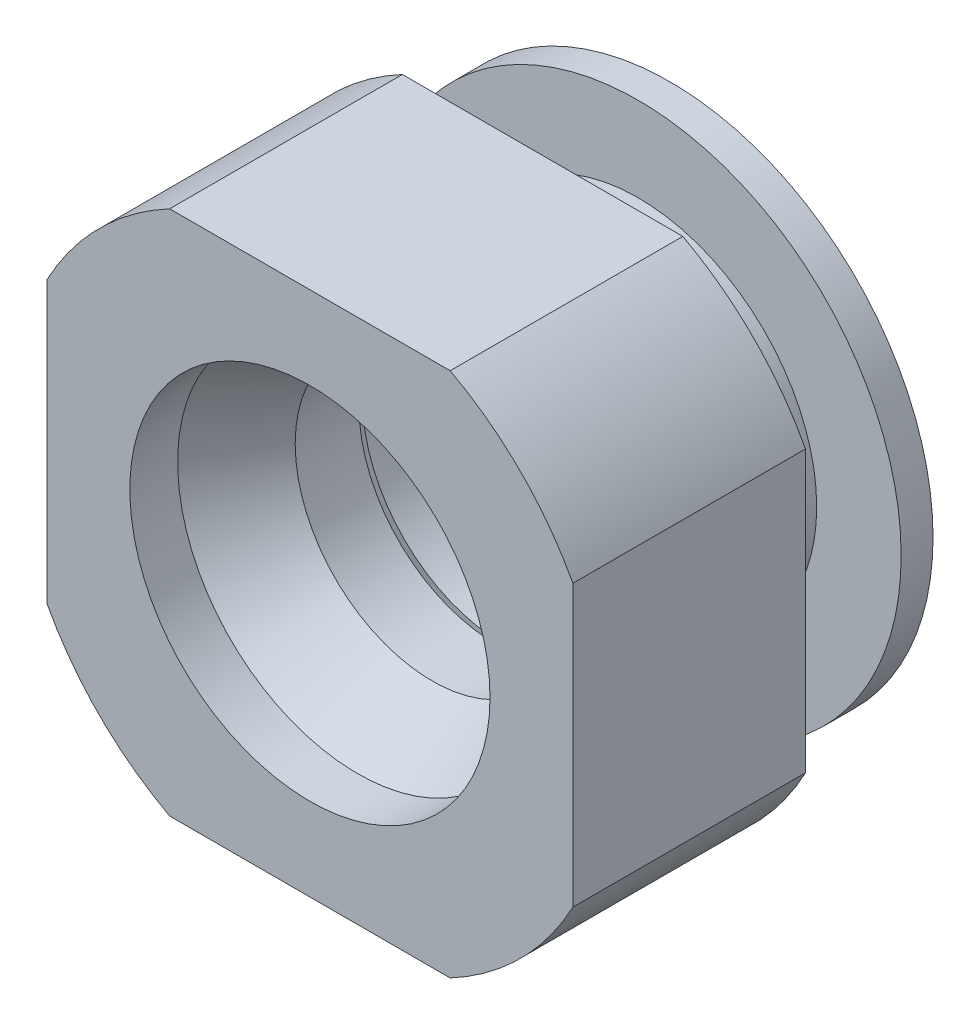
ISO-10303-21;
HEADER;
FILE_DESCRIPTION(('STEP AP214'),'2;1');
FILE_NAME('part.step','',(''),(''),'','','');
FILE_SCHEMA(('AUTOMOTIVE_DESIGN { 1 0 10303 214 1 1 1 1 }'));
ENDSEC;
DATA;
#1=APPLICATION_CONTEXT('core data for automotive mechanical design processes');
#2=APPLICATION_PROTOCOL_DEFINITION('international standard','automotive_design',2000,#1);
#3=PRODUCT_CONTEXT('',#1,'mechanical');
#4=PRODUCT('Part','Part','',(#3));
#5=PRODUCT_RELATED_PRODUCT_CATEGORY('part','',(#4));
#6=PRODUCT_DEFINITION_FORMATION('','',#4);
#7=PRODUCT_DEFINITION_CONTEXT('part definition',#1,'design');
#8=PRODUCT_DEFINITION('design','',#6,#7);
#9=PRODUCT_DEFINITION_SHAPE('','',#8);
#10=(LENGTH_UNIT() NAMED_UNIT(*) SI_UNIT(.MILLI.,.METRE.));
#11=(NAMED_UNIT(*) PLANE_ANGLE_UNIT() SI_UNIT($,.RADIAN.));
#12=(NAMED_UNIT(*) SI_UNIT($,.STERADIAN.) SOLID_ANGLE_UNIT());
#13=UNCERTAINTY_MEASURE_WITH_UNIT(LENGTH_MEASURE(1.E-05),#10,'distance_accuracy_value','');
#14=(GEOMETRIC_REPRESENTATION_CONTEXT(3) GLOBAL_UNCERTAINTY_ASSIGNED_CONTEXT((#13)) GLOBAL_UNIT_ASSIGNED_CONTEXT((#10,
#11,#12)) REPRESENTATION_CONTEXT('',''));
#15=CARTESIAN_POINT('',(0.,0.,0.));
#16=DIRECTION('',(0.,0.,1.));
#17=DIRECTION('',(1.,0.,0.));
#18=AXIS2_PLACEMENT_3D('',#15,#16,#17);
#19=CARTESIAN_POINT('',(0.,0.,-1.3335));
#20=DIRECTION('',(0.,1.,0.));
#21=DIRECTION('',(0.,0.,-1.));
#22=AXIS2_PLACEMENT_3D('',#19,#20,#21);
#23=SPHERICAL_SURFACE('',#22,0.1524);
#24=CARTESIAN_POINT('',(0.,0.,-1.3335));
#25=DIRECTION('',(0.,0.,1.));
#26=DIRECTION('',(1.,0.,0.));
#27=AXIS2_PLACEMENT_3D('',#24,#25,#26);
#28=CIRCLE('',#27,0.1524);
#29=CARTESIAN_POINT('',(0.,-0.1524,-1.3335));
#30=VERTEX_POINT('',#29);
#31=CARTESIAN_POINT('',(0.,0.1524,-1.3335));
#32=VERTEX_POINT('',#31);
#33=EDGE_CURVE('E266',#30,#32,#28,.F.);
#34=ORIENTED_EDGE('',*,*,#33,.F.);
#35=CARTESIAN_POINT('',(0.,0.,-1.3335));
#36=DIRECTION('',(0.,0.,1.));
#37=DIRECTION('',(1.,0.,0.));
#38=AXIS2_PLACEMENT_3D('',#35,#36,#37);
#39=CIRCLE('',#38,0.1524);
#40=EDGE_CURVE('E942',#32,#30,#39,.F.);
#41=ORIENTED_EDGE('',*,*,#40,.F.);
#42=EDGE_LOOP('',(#34,#41));
#43=FACE_BOUND('',#42,.T.);
#44=ADVANCED_FACE('F17',(#43),#23,.T.);
#45=CARTESIAN_POINT('',(0.,0.,-2.286));
#46=DIRECTION('',(0.,0.,1.));
#47=DIRECTION('',(1.,0.,0.));
#48=AXIS2_PLACEMENT_3D('',#45,#46,#47);
#49=CYLINDRICAL_SURFACE('',#48,0.1524);
#50=ORIENTED_EDGE('',*,*,#40,.T.);
#51=ORIENTED_EDGE('',*,*,#33,.T.);
#52=EDGE_LOOP('',(#50,#51));
#53=FACE_BOUND('',#52,.T.);
#54=CARTESIAN_POINT('',(0.,0.,-2.1715149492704));
#55=DIRECTION('',(0.,0.,1.));
#56=DIRECTION('',(1.,0.,0.));
#57=AXIS2_PLACEMENT_3D('',#54,#55,#56);
#58=CIRCLE('',#57,0.1524);
#59=CARTESIAN_POINT('',(0.1524,0.,-2.1715149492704));
#60=VERTEX_POINT('',#59);
#61=EDGE_CURVE('E21',#60,#60,#58,.T.);
#62=ORIENTED_EDGE('',*,*,#61,.T.);
#63=EDGE_LOOP('',(#62));
#64=FACE_BOUND('',#63,.T.);
#65=ADVANCED_FACE('F629',(#53,#64),#49,.T.);
#66=CARTESIAN_POINT('',(0.,0.939296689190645,-2.1715149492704));
#67=DIRECTION('',(0.,0.,-1.));
#68=DIRECTION('',(-1.,0.,0.));
#69=AXIS2_PLACEMENT_3D('',#66,#67,#68);
#70=PLANE('',#69);
#71=CARTESIAN_POINT('',(0.,0.,-2.1715149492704));
#72=DIRECTION('',(0.,0.,1.));
#73=DIRECTION('',(1.,0.,0.));
#74=AXIS2_PLACEMENT_3D('',#71,#72,#73);
#75=CIRCLE('',#74,0.1651);
#76=CARTESIAN_POINT('',(0.1651,0.,-2.1715149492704));
#77=VERTEX_POINT('',#76);
#78=EDGE_CURVE('E1001',#77,#77,#75,.T.);
#79=ORIENTED_EDGE('',*,*,#78,.T.);
#80=EDGE_LOOP('',(#79));
#81=FACE_BOUND('',#80,.T.);
#82=ORIENTED_EDGE('',*,*,#61,.F.);
#83=EDGE_LOOP('',(#82));
#84=FACE_BOUND('',#83,.T.);
#85=ADVANCED_FACE('F626',(#81,#84),#70,.F.);
#86=CARTESIAN_POINT('',(0.,0.,-2.159));
#87=DIRECTION('',(0.,0.,1.));
#88=DIRECTION('',(1.,0.,0.));
#89=AXIS2_PLACEMENT_3D('',#86,#87,#88);
#90=CYLINDRICAL_SURFACE('',#89,0.1651);
#91=ORIENTED_EDGE('',*,*,#78,.F.);
#92=EDGE_LOOP('',(#91));
#93=FACE_BOUND('',#92,.T.);
#94=CARTESIAN_POINT('',(0.,0.,-2.159));
#95=DIRECTION('',(0.,0.,1.));
#96=DIRECTION('',(1.,0.,0.));
#97=AXIS2_PLACEMENT_3D('',#94,#95,#96);
#98=CIRCLE('',#97,0.1651);
#99=CARTESIAN_POINT('',(0.1651,0.,-2.159));
#100=VERTEX_POINT('',#99);
#101=EDGE_CURVE('E996',#100,#100,#98,.T.);
#102=ORIENTED_EDGE('',*,*,#101,.T.);
#103=EDGE_LOOP('',(#102));
#104=FACE_BOUND('',#103,.T.);
#105=ADVANCED_FACE('F622',(#93,#104),#90,.F.);
#106=CARTESIAN_POINT('',(0.,0.8382,-2.159));
#107=DIRECTION('',(0.,0.,-1.));
#108=DIRECTION('',(-1.,0.,0.));
#109=AXIS2_PLACEMENT_3D('',#106,#107,#108);
#110=PLANE('',#109);
#111=CARTESIAN_POINT('',(0.,0.,-2.159));
#112=DIRECTION('',(0.,0.,1.));
#113=DIRECTION('',(1.,0.,0.));
#114=AXIS2_PLACEMENT_3D('',#111,#112,#113);
#115=CIRCLE('',#114,0.8382);
#116=CARTESIAN_POINT('',(0.8382,0.,-2.159));
#117=VERTEX_POINT('',#116);
#118=EDGE_CURVE('E989',#117,#117,#115,.F.);
#119=ORIENTED_EDGE('',*,*,#118,.F.);
#120=EDGE_LOOP('',(#119));
#121=FACE_BOUND('',#120,.T.);
#122=ORIENTED_EDGE('',*,*,#101,.F.);
#123=EDGE_LOOP('',(#122));
#124=FACE_BOUND('',#123,.T.);
#125=ADVANCED_FACE('F618',(#121,#124),#110,.F.);
#126=CARTESIAN_POINT('',(0.,-2.8702,-2.6924));
#127=DIRECTION('',(0.,-1.,0.));
#128=DIRECTION('',(0.,0.,-1.));
#129=AXIS2_PLACEMENT_3D('',#126,#127,#128);
#130=PLANE('',#129);
#131=CARTESIAN_POINT('',(0.,-2.87019999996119,-2.6924));
#132=DIRECTION('',(0.,1.,0.));
#133=DIRECTION('',(0.,0.,1.));
#134=AXIS2_PLACEMENT_3D('',#131,#132,#133);
#135=CIRCLE('',#134,0.0508000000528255);
#136=CARTESIAN_POINT('',(0.,-2.87019999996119,-2.64159999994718));
#137=VERTEX_POINT('',#136);
#138=EDGE_CURVE('E993',#137,#137,#135,.T.);
#139=ORIENTED_EDGE('',*,*,#138,.F.);
#140=EDGE_LOOP('',(#139));
#141=FACE_BOUND('',#140,.T.);
#142=ADVANCED_FACE('F614',(#141),#130,.T.);
#143=CARTESIAN_POINT('',(0.,0.115641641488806,-2.3046904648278));
#144=DIRECTION('',(0.,0.,1.));
#145=DIRECTION('',(1.,0.,0.));
#146=AXIS2_PLACEMENT_3D('',#143,#144,#145);
#147=PLANE('',#146);
#148=CARTESIAN_POINT('',(0.,0.,-2.3046904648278));
#149=DIRECTION('',(0.,0.,1.));
#150=DIRECTION('',(1.,0.,0.));
#151=AXIS2_PLACEMENT_3D('',#148,#149,#150);
#152=CIRCLE('',#151,0.1651);
#153=CARTESIAN_POINT('',(0.1651,0.,-2.3046904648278));
#154=VERTEX_POINT('',#153);
#155=EDGE_CURVE('E990',#154,#154,#152,.F.);
#156=ORIENTED_EDGE('',*,*,#155,.T.);
#157=EDGE_LOOP('',(#156));
#158=FACE_BOUND('',#157,.T.);
#159=CARTESIAN_POINT('',(0.,0.152087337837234,-2.3046904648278));
#160=CARTESIAN_POINT('',(0.0170688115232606,0.152076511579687,-2.30469046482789));
#161=CARTESIAN_POINT('',(0.034242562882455,0.149166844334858,-2.30469046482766));
#162=CARTESIAN_POINT('',(0.0666022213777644,0.137832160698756,-2.30469046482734));
#163=CARTESIAN_POINT('',(0.0817881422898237,0.129407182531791,-2.30469046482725));
#164=CARTESIAN_POINT('',(0.108534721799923,0.108003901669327,-2.30469046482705));
#165=CARTESIAN_POINT('',(0.120094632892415,0.0950246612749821,-2.30469046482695));
#166=CARTESIAN_POINT('',(0.138272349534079,0.0659663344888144,-2.30469046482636));
#167=CARTESIAN_POINT('',(0.144887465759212,0.0498855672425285,-2.30469046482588));
#168=CARTESIAN_POINT('',(0.152433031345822,0.0164286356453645,-2.3046904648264));
#169=CARTESIAN_POINT('',(0.153359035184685,-0.000948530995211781,-2.3046904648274));
#170=CARTESIAN_POINT('',(0.149413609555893,-0.0350468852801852,-2.30469046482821));
#171=CARTESIAN_POINT('',(0.144537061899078,-0.051767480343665,-2.30469046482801));
#172=CARTESIAN_POINT('',(0.129519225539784,-0.0826640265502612,-2.30469046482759));
#173=CARTESIAN_POINT('',(0.119374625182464,-0.0968383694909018,-2.30469046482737));
#174=CARTESIAN_POINT('',(0.0949801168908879,-0.12102604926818,-2.30469046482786));
#175=CARTESIAN_POINT('',(0.0807312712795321,-0.131040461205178,-2.30469046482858));
#176=CARTESIAN_POINT('',(0.0496851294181,-0.145751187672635,-2.30469046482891));
#177=CARTESIAN_POINT('',(0.0328921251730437,-0.150456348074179,-2.30469046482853));
#178=CARTESIAN_POINT('',(0.0106159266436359,-0.152813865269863,-2.30469046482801));
#179=CARTESIAN_POINT('',(0.00531306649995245,-0.15309200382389,-2.30469046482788));
#180=CARTESIAN_POINT('',(-0.0170469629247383,-0.153077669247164,-2.30469046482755));
#181=CARTESIAN_POINT('',(-0.0341989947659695,-0.150168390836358,-2.3046904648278));
#182=CARTESIAN_POINT('',(-0.0665149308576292,-0.138843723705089,-2.30469046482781));
#183=CARTESIAN_POINT('',(-0.0816789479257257,-0.130428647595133,-2.30469046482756));
#184=CARTESIAN_POINT('',(-0.10841454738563,-0.109048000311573,-2.30469046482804));
#185=CARTESIAN_POINT('',(-0.119980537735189,-0.0960754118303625,-2.30469046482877));
#186=CARTESIAN_POINT('',(-0.13819714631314,-0.0670093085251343,-2.3046904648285));
#187=CARTESIAN_POINT('',(-0.144837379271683,-0.0509092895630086,-2.3046904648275));
#188=CARTESIAN_POINT('',(-0.152422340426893,-0.0174058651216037,-2.30469046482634));
#189=CARTESIAN_POINT('',(-0.153362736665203,-1.47847120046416E-06,-2.30469046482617));
#190=CARTESIAN_POINT('',(-0.149426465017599,0.0341303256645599,-2.30469046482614));
#191=CARTESIAN_POINT('',(-0.144552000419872,0.0508579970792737,-2.30469046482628));
#192=CARTESIAN_POINT('',(-0.129536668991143,0.0817390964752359,-2.30469046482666));
#193=CARTESIAN_POINT('',(-0.119400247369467,0.0958946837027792,-2.3046904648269));
#194=CARTESIAN_POINT('',(-0.0950341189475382,0.120038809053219,-2.30469046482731));
#195=CARTESIAN_POINT('',(-0.0808078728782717,0.130030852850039,-2.30469046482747));
#196=CARTESIAN_POINT('',(-0.0498021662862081,0.144724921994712,-2.3046904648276));
#197=CARTESIAN_POINT('',(-0.0330243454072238,0.149430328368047,-2.30469046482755));
#198=CARTESIAN_POINT('',(-0.0107135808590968,0.15180807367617,-2.30469046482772));
#199=CARTESIAN_POINT('',(-0.00536196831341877,0.152090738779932,-2.30469046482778));
#200=CARTESIAN_POINT('',(0.,0.152087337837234,-2.3046904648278));
#201=B_SPLINE_CURVE_WITH_KNOTS('',3,(#159,#160,#161,#162,#163,#164,#165,#166,#167,#168,#169,
#170,#171,#172,#173,#174,#175,#176,#177,#178,#179,#180,#181,#182,#183,#184,#185,#186,#187,#188,
#189,#190,#191,#192,#193,#194,#195,#196,#197,#198,#199,#200),.UNSPECIFIED.,.T.,.F.,(4,2,2,2,2,2,
2,2,2,2,2,2,2,2,2,2,2,2,2,2,4),(0.,0.051148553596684,0.102296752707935,0.15345548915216,
0.20464202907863,0.255868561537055,0.307140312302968,0.358444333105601,0.4097350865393,
0.46094025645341,0.476861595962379,0.527945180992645,0.57902586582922,0.630185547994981,
0.68145278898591,0.732758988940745,0.784045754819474,0.835289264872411,0.886489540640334,
0.937657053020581,0.953724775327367),.UNSPECIFIED.);
#202=CARTESIAN_POINT('',(0.,0.152087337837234,-2.3046904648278));
#203=VERTEX_POINT('',#202);
#204=EDGE_CURVE('E599',#203,#203,#201,.T.);
#205=ORIENTED_EDGE('',*,*,#204,.F.);
#206=EDGE_LOOP('',(#205));
#207=FACE_BOUND('',#206,.T.);
#208=ADVANCED_FACE('F608',(#158,#207),#147,.F.);
#209=CARTESIAN_POINT('',(0.,0.,-2.159));
#210=DIRECTION('',(0.,0.,1.));
#211=DIRECTION('',(1.,0.,0.));
#212=AXIS2_PLACEMENT_3D('',#209,#210,#211);
#213=CYLINDRICAL_SURFACE('',#212,0.1651);
#214=ORIENTED_EDGE('',*,*,#155,.F.);
#215=EDGE_LOOP('',(#214));
#216=FACE_BOUND('',#215,.T.);
#217=CARTESIAN_POINT('',(0.,0.,-2.3876));
#218=DIRECTION('',(0.,0.,1.));
#219=DIRECTION('',(1.,0.,0.));
#220=AXIS2_PLACEMENT_3D('',#217,#218,#219);
#221=CIRCLE('',#220,0.1651);
#222=CARTESIAN_POINT('',(0.110145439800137,-0.122987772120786,-2.3876));
#223=VERTEX_POINT('',#222);
#224=CARTESIAN_POINT('',(-0.110145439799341,-0.12298777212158,-2.3876));
#225=VERTEX_POINT('',#224);
#226=EDGE_CURVE('E988',#223,#225,#221,.T.);
#227=ORIENTED_EDGE('',*,*,#226,.F.);
#228=CARTESIAN_POINT('',(-0.110145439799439,-0.122987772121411,-2.38759999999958));
#229=CARTESIAN_POINT('',(-0.104523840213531,-0.128045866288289,-2.38423390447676));
#230=CARTESIAN_POINT('',(-0.0983826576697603,-0.132825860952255,-2.38135817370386));
#231=CARTESIAN_POINT('',(-0.0852625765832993,-0.141594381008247,-2.37643275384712));
#232=CARTESIAN_POINT('',(-0.0782840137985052,-0.145583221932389,-2.37438273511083));
#233=CARTESIAN_POINT('',(-0.0636937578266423,-0.152534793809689,-2.37095347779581));
#234=CARTESIAN_POINT('',(-0.0560827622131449,-0.155498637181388,-2.36957351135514));
#235=CARTESIAN_POINT('',(-0.040443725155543,-0.160277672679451,-2.36740133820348));
#236=CARTESIAN_POINT('',(-0.0324164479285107,-0.162094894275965,-2.36660809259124));
#237=CARTESIAN_POINT('',(-0.0162577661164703,-0.164497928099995,-2.36556679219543));
#238=CARTESIAN_POINT('',(-0.00812924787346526,-0.165100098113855,-2.36531149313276));
#239=CARTESIAN_POINT('',(0.00849758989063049,-0.165099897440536,-2.3653114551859));
#240=CARTESIAN_POINT('',(0.0169959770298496,-0.164441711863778,-2.3655903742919));
#241=CARTESIAN_POINT('',(0.0337535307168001,-0.16183505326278,-2.36672161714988));
#242=CARTESIAN_POINT('',(0.0420126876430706,-0.159886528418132,-2.36757396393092));
#243=CARTESIAN_POINT('',(0.0580699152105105,-0.154780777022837,-2.36990606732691));
#244=CARTESIAN_POINT('',(0.0658672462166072,-0.151621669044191,-2.37138680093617));
#245=CARTESIAN_POINT('',(0.0807439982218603,-0.144245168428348,-2.37506737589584));
#246=CARTESIAN_POINT('',(0.0878248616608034,-0.140029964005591,-2.37726573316));
#247=CARTESIAN_POINT('',(0.100027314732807,-0.131529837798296,-2.38213938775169));
#248=CARTESIAN_POINT('',(0.105281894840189,-0.127360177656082,-2.38468527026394));
#249=CARTESIAN_POINT('',(0.110145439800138,-0.122987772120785,-2.3876));
#250=B_SPLINE_CURVE_WITH_KNOTS('',3,(#228,#229,#230,#231,#232,#233,#234,#235,#236,#237,#238,
#239,#240,#241,#242,#243,#244,#245,#246,#247,#248,#249),.UNSPECIFIED.,.F.,.F.,(4,2,2,2,2,2,2,2,
2,2,4),(0.,0.0247760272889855,0.0495421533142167,0.0742813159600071,0.0989765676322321,
0.123337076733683,0.148801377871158,0.17426670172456,0.199771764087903,0.2252244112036,
0.246673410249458),.UNSPECIFIED.);
#251=EDGE_CURVE('E258',#225,#223,#250,.T.);
#252=ORIENTED_EDGE('',*,*,#251,.F.);
#253=EDGE_LOOP('',(#227,#252));
#254=FACE_BOUND('',#253,.T.);
#255=ADVANCED_FACE('F604',(#216,#254),#213,.F.);
#256=CARTESIAN_POINT('',(0.,0.,-2.3876));
#257=DIRECTION('',(0.,0.,-1.));
#258=DIRECTION('',(-1.,0.,0.));
#259=AXIS2_PLACEMENT_3D('',#256,#257,#258);
#260=PLANE('',#259);
#261=ORIENTED_EDGE('',*,*,#226,.T.);
#262=CARTESIAN_POINT('',(0.110145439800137,-0.122987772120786,-2.3876));
#263=CARTESIAN_POINT('',(0.10438259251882,-0.129397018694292,-2.38759999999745));
#264=CARTESIAN_POINT('',(0.0980961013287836,-0.135345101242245,-2.38759999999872));
#265=CARTESIAN_POINT('',(0.0846073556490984,-0.146159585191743,-2.38760000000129));
#266=CARTESIAN_POINT('',(0.0774010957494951,-0.151020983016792,-2.38760000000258));
#267=CARTESIAN_POINT('',(0.0622397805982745,-0.15945237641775,-2.38759999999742));
#268=CARTESIAN_POINT('',(0.0542828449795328,-0.163019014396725,-2.38759999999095));
#269=CARTESIAN_POINT('',(0.0378853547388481,-0.168662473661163,-2.38760000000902));
#270=CARTESIAN_POINT('',(0.0294467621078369,-0.170744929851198,-2.38760000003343));
#271=CARTESIAN_POINT('',(0.0139796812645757,-0.173079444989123,-2.38760000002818));
#272=CARTESIAN_POINT('',(0.00699128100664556,-0.173606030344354,-2.38760000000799));
#273=CARTESIAN_POINT('',(-0.00811596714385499,-0.173604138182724,-2.38759999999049));
#274=CARTESIAN_POINT('',(-0.0162358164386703,-0.172892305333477,-2.38759999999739));
#275=CARTESIAN_POINT('',(-0.0322386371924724,-0.170088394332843,-2.38760000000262));
#276=CARTESIAN_POINT('',(-0.0401211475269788,-0.167993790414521,-2.38760000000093));
#277=CARTESIAN_POINT('',(-0.0630059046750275,-0.159780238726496,-2.38759999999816));
#278=CARTESIAN_POINT('',(-0.0773540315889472,-0.151729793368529,-2.38759999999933));
#279=CARTESIAN_POINT('',(-0.0973442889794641,-0.136070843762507,-2.38760000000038));
#280=CARTESIAN_POINT('',(-0.104064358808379,-0.129783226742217,-2.3876000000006));
#281=CARTESIAN_POINT('',(-0.110145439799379,-0.122987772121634,-2.38760000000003));
#282=B_SPLINE_CURVE_WITH_KNOTS('',3,(#262,#263,#264,#265,#266,#267,#268,#269,#270,#271,#272,
#273,#274,#275,#276,#277,#278,#279,#280,#281),.UNSPECIFIED.,.F.,.F.,(4,2,2,2,2,2,2,2,2,4),(0.,
0.0258414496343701,0.0517995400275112,0.0778244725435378,0.103750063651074,0.124701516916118,
0.149023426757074,0.173389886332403,0.221812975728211,0.249247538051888),.UNSPECIFIED.);
#283=EDGE_CURVE('E589',#223,#225,#282,.T.);
#284=ORIENTED_EDGE('',*,*,#283,.F.);
#285=EDGE_LOOP('',(#261,#284));
#286=FACE_BOUND('',#285,.T.);
#287=CARTESIAN_POINT('',(0.,0.,-2.3876));
#288=DIRECTION('',(0.,0.,-1.));
#289=DIRECTION('',(-1.,0.,0.));
#290=AXIS2_PLACEMENT_3D('',#287,#288,#289);
#291=CIRCLE('',#290,0.3302);
#292=CARTESIAN_POINT('',(-0.3302,0.,-2.3876));
#293=VERTEX_POINT('',#292);
#294=EDGE_CURVE('E979',#293,#293,#291,.T.);
#295=ORIENTED_EDGE('',*,*,#294,.T.);
#296=EDGE_LOOP('',(#295));
#297=FACE_BOUND('',#296,.T.);
#298=ADVANCED_FACE('F607',(#286,#297),#260,.T.);
#299=CARTESIAN_POINT('',(0.,0.,-2.159));
#300=DIRECTION('',(0.,0.,1.));
#301=DIRECTION('',(1.,0.,0.));
#302=AXIS2_PLACEMENT_3D('',#299,#300,#301);
#303=CYLINDRICAL_SURFACE('',#302,0.8382);
#304=ORIENTED_EDGE('',*,*,#118,.T.);
#305=EDGE_LOOP('',(#304));
#306=FACE_BOUND('',#305,.T.);
#307=CARTESIAN_POINT('',(0.,0.,-2.1715149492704));
#308=DIRECTION('',(0.,0.,1.));
#309=DIRECTION('',(1.,0.,0.));
#310=AXIS2_PLACEMENT_3D('',#307,#308,#309);
#311=CIRCLE('',#310,0.8382);
#312=CARTESIAN_POINT('',(0.8382,0.,-2.1715149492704));
#313=VERTEX_POINT('',#312);
#314=EDGE_CURVE('E552',#313,#313,#311,.T.);
#315=ORIENTED_EDGE('',*,*,#314,.T.);
#316=EDGE_LOOP('',(#315));
#317=FACE_BOUND('',#316,.T.);
#318=ADVANCED_FACE('F1440',(#306,#317),#303,.T.);
#319=CARTESIAN_POINT('',(0.,-2.76860000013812,-2.6924));
#320=DIRECTION('',(0.,1.,0.));
#321=DIRECTION('',(0.,0.,1.));
#322=AXIS2_PLACEMENT_3D('',#319,#320,#321);
#323=CONICAL_SURFACE('',#322,0.152399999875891,0.785398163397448);
#324=CARTESIAN_POINT('',(0.,-2.7686,-2.6924));
#325=DIRECTION('',(0.,-1.,0.));
#326=DIRECTION('',(0.,0.,-1.));
#327=AXIS2_PLACEMENT_3D('',#324,#325,#326);
#328=CIRCLE('',#327,0.1524);
#329=CARTESIAN_POINT('',(0.,-2.7686,-2.53999999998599));
#330=VERTEX_POINT('',#329);
#331=EDGE_CURVE('E554',#330,#330,#328,.F.);
#332=CARTESIAN_POINT('',(0.,-2.7686,-2.53999999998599));
#333=CARTESIAN_POINT('',(0.,-2.76965833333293,-2.54105833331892));
#334=CARTESIAN_POINT('',(0.,-2.77071666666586,-2.54211666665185));
#335=CARTESIAN_POINT('',(0.,-2.77283333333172,-2.5442333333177));
#336=CARTESIAN_POINT('',(0.,-2.77389166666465,-2.54529166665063));
#337=CARTESIAN_POINT('',(0.,-2.7760083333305,-2.54740833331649));
#338=CARTESIAN_POINT('',(0.,-2.77706666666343,-2.54846666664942));
#339=CARTESIAN_POINT('',(0.,-2.77918333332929,-2.55058333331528));
#340=CARTESIAN_POINT('',(0.,-2.78024166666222,-2.55164166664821));
#341=CARTESIAN_POINT('',(0.,-2.78235833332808,-2.55375833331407));
#342=CARTESIAN_POINT('',(0.,-2.78341666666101,-2.55481666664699));
#343=CARTESIAN_POINT('',(0.,-2.78553333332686,-2.55693333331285));
#344=CARTESIAN_POINT('',(0.,-2.78659166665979,-2.55799166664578));
#345=CARTESIAN_POINT('',(0.,-2.78870833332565,-2.56010833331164));
#346=CARTESIAN_POINT('',(0.,-2.78976666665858,-2.56116666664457));
#347=CARTESIAN_POINT('',(0.,-2.79188333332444,-2.56328333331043));
#348=CARTESIAN_POINT('',(0.,-2.79294166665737,-2.56434166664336));
#349=CARTESIAN_POINT('',(0.,-2.79505833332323,-2.56645833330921));
#350=CARTESIAN_POINT('',(0.,-2.79611666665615,-2.56751666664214));
#351=CARTESIAN_POINT('',(0.,-2.79823333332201,-2.569633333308));
#352=CARTESIAN_POINT('',(0.,-2.79929166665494,-2.57069166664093));
#353=CARTESIAN_POINT('',(0.,-2.8014083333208,-2.57280833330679));
#354=CARTESIAN_POINT('',(0.,-2.80246666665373,-2.57386666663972));
#355=CARTESIAN_POINT('',(0.,-2.80458333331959,-2.57598333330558));
#356=CARTESIAN_POINT('',(0.,-2.80564166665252,-2.5770416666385));
#357=CARTESIAN_POINT('',(0.,-2.80775833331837,-2.57915833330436));
#358=CARTESIAN_POINT('',(0.,-2.8088166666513,-2.58021666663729));
#359=CARTESIAN_POINT('',(0.,-2.81093333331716,-2.58233333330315));
#360=CARTESIAN_POINT('',(0.,-2.81199166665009,-2.58339166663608));
#361=CARTESIAN_POINT('',(0.,-2.81410833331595,-2.58550833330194));
#362=CARTESIAN_POINT('',(0.,-2.81516666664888,-2.58656666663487));
#363=CARTESIAN_POINT('',(0.,-2.81728333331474,-2.58868333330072));
#364=CARTESIAN_POINT('',(0.,-2.81834166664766,-2.58974166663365));
#365=CARTESIAN_POINT('',(0.,-2.82045833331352,-2.59185833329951));
#366=CARTESIAN_POINT('',(0.,-2.82151666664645,-2.59291666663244));
#367=CARTESIAN_POINT('',(0.,-2.82363333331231,-2.5950333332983));
#368=CARTESIAN_POINT('',(0.,-2.82469166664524,-2.59609166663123));
#369=CARTESIAN_POINT('',(0.,-2.8268083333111,-2.59820833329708));
#370=CARTESIAN_POINT('',(0.,-2.82786666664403,-2.59926666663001));
#371=CARTESIAN_POINT('',(0.,-2.82998333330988,-2.60138333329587));
#372=CARTESIAN_POINT('',(0.,-2.83104166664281,-2.6024416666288));
#373=CARTESIAN_POINT('',(0.,-2.83315833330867,-2.60455833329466));
#374=CARTESIAN_POINT('',(0.,-2.8342166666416,-2.60561666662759));
#375=CARTESIAN_POINT('',(0.,-2.83633333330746,-2.60773333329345));
#376=CARTESIAN_POINT('',(0.,-2.83739166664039,-2.60879166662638));
#377=CARTESIAN_POINT('',(0.,-2.83950833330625,-2.61090833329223));
#378=CARTESIAN_POINT('',(0.,-2.84056666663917,-2.61196666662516));
#379=CARTESIAN_POINT('',(0.,-2.84268333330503,-2.61408333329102));
#380=CARTESIAN_POINT('',(0.,-2.84374166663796,-2.61514166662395));
#381=CARTESIAN_POINT('',(0.,-2.84585833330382,-2.61725833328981));
#382=CARTESIAN_POINT('',(0.,-2.84691666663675,-2.61831666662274));
#383=CARTESIAN_POINT('',(0.,-2.84903333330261,-2.62043333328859));
#384=CARTESIAN_POINT('',(0.,-2.85009166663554,-2.62149166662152));
#385=CARTESIAN_POINT('',(0.,-2.85220833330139,-2.62360833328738));
#386=CARTESIAN_POINT('',(0.,-2.85326666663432,-2.62466666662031));
#387=CARTESIAN_POINT('',(0.,-2.85538333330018,-2.62678333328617));
#388=CARTESIAN_POINT('',(0.,-2.85644166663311,-2.6278416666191));
#389=CARTESIAN_POINT('',(0.,-2.85855833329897,-2.62995833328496));
#390=CARTESIAN_POINT('',(0.,-2.8596166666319,-2.63101666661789));
#391=CARTESIAN_POINT('',(0.,-2.86173333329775,-2.63313333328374));
#392=CARTESIAN_POINT('',(0.,-2.86279166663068,-2.63419166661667));
#393=CARTESIAN_POINT('',(0.,-2.86490833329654,-2.63630833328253));
#394=CARTESIAN_POINT('',(0.,-2.86596666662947,-2.63736666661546));
#395=CARTESIAN_POINT('',(0.,-2.86808333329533,-2.63948333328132));
#396=CARTESIAN_POINT('',(0.,-2.86914166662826,-2.64054166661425));
#397=CARTESIAN_POINT('',(0.,-2.87019999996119,-2.64159999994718));
#398=B_SPLINE_CURVE_WITH_KNOTS('',3,(#332,#333,#334,#335,#336,#337,#338,#339,#340,#341,#342,
#343,#344,#345,#346,#347,#348,#349,#350,#351,#352,#353,#354,#355,#356,#357,#358,#359,#360,#361,
#362,#363,#364,#365,#366,#367,#368,#369,#370,#371,#372,#373,#374,#375,#376,#377,#378,#379,#380,
#381,#382,#383,#384,#385,#386,#387,#388,#389,#390,#391,#392,#393,#394,#395,#396,#397),
.UNSPECIFIED.,.F.,.F.,(4,2,2,2,2,2,2,2,2,2,2,2,2,2,2,2,2,2,2,2,2,2,2,2,2,2,2,2,2,2,2,2,4),(0.,
0.00449012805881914,0.00898025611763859,0.013470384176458,0.0179605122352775,0.0224506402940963,
0.0269407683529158,0.0314308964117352,0.035921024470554,0.0404111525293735,0.0449012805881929,
0.0493914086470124,0.0538815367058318,0.0583716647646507,0.0628617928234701,0.0673519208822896,
0.0718420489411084,0.0763321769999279,0.0808223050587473,0.0853124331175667,0.0898025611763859,
0.094292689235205,0.0987828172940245,0.103272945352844,0.107763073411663,0.112253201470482,
0.116743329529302,0.121233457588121,0.12572358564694,0.130213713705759,0.134703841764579,
0.139193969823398,0.143684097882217),.UNSPECIFIED.);
#399=EDGE_CURVE('BSEAM567',#330,#137,#398,.T.);
#400=ORIENTED_EDGE('',*,*,#331,.F.);
#401=ORIENTED_EDGE('',*,*,#138,.T.);
#402=ORIENTED_EDGE('',*,*,#399,.T.);
#403=ORIENTED_EDGE('',*,*,#399,.F.);
#404=EDGE_LOOP('',(#400,#402,#401,#403));
#405=FACE_BOUND('',#404,.T.);
#406=ADVANCED_FACE('F567',(#405),#323,.T.);
#407=CARTESIAN_POINT('',(0.,-0.4064,-2.286));
#408=DIRECTION('',(-1.,0.,0.));
#409=DIRECTION('',(0.,0.,1.));
#410=AXIS2_PLACEMENT_3D('',#407,#408,#409);
#411=TOROIDAL_SURFACE('',#410,0.4064,0.1524);
#412=ORIENTED_EDGE('',*,*,#204,.T.);
#413=EDGE_LOOP('',(#412));
#414=FACE_BOUND('',#413,.T.);
#415=ORIENTED_EDGE('',*,*,#283,.T.);
#416=ORIENTED_EDGE('',*,*,#251,.T.);
#417=EDGE_LOOP('',(#415,#416));
#418=FACE_BOUND('',#417,.T.);
#419=CARTESIAN_POINT('',(0.127,-0.4064,-2.286));
#420=DIRECTION('',(-1.,0.,0.));
#421=DIRECTION('',(0.,0.,1.));
#422=AXIS2_PLACEMENT_3D('',#419,#420,#421);
#423=CIRCLE('',#422,0.490642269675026);
#424=CARTESIAN_POINT('',(0.127000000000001,-0.3048,-2.76600757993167));
#425=VERTEX_POINT('',#424);
#426=CARTESIAN_POINT('',(0.127,-0.4064,-2.77664226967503));
#427=VERTEX_POINT('',#426);
#428=EDGE_CURVE('E494',#425,#427,#423,.T.);
#429=ORIENTED_EDGE('',*,*,#428,.T.);
#430=CARTESIAN_POINT('',(0.,-0.4064,-2.6924));
#431=DIRECTION('',(0.,-1.,0.));
#432=DIRECTION('',(0.,0.,-1.));
#433=AXIS2_PLACEMENT_3D('',#430,#431,#432);
#434=CIRCLE('',#433,0.1524);
#435=CARTESIAN_POINT('',(-0.127,-0.4064,-2.77664226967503));
#436=VERTEX_POINT('',#435);
#437=EDGE_CURVE('E501',#436,#427,#434,.T.);
#438=ORIENTED_EDGE('',*,*,#437,.F.);
#439=CARTESIAN_POINT('',(-0.127,-0.4064,-2.286));
#440=DIRECTION('',(-1.,0.,0.));
#441=DIRECTION('',(0.,0.,1.));
#442=AXIS2_PLACEMENT_3D('',#439,#440,#441);
#443=CIRCLE('',#442,0.490642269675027);
#444=CARTESIAN_POINT('',(-0.127,-0.3048,-2.76600757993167));
#445=VERTEX_POINT('',#444);
#446=EDGE_CURVE('E528',#436,#445,#443,.F.);
#447=ORIENTED_EDGE('',*,*,#446,.T.);
#448=CARTESIAN_POINT('',(-0.127,-0.3048,-2.76600757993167));
#449=CARTESIAN_POINT('',(-0.131734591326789,-0.302821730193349,-2.75829294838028));
#450=CARTESIAN_POINT('',(-0.135864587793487,-0.300976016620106,-2.75016261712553));
#451=CARTESIAN_POINT('',(-0.142838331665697,-0.297733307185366,-2.73323020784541));
#452=CARTESIAN_POINT('',(-0.145674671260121,-0.296338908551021,-2.72442459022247));
#453=CARTESIAN_POINT('',(-0.149934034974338,-0.294206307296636,-2.70636866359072));
#454=CARTESIAN_POINT('',(-0.151353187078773,-0.293469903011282,-2.69711720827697));
#455=CARTESIAN_POINT('',(-0.152642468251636,-0.292802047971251,-2.67849408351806));
#456=CARTESIAN_POINT('',(-0.152516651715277,-0.292868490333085,-2.6691227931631));
#457=CARTESIAN_POINT('',(-0.150717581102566,-0.293797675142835,-2.6513995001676));
#458=CARTESIAN_POINT('',(-0.149180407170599,-0.294590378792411,-2.64302994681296));
#459=CARTESIAN_POINT('',(-0.144732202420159,-0.296800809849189,-2.62674851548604));
#460=CARTESIAN_POINT('',(-0.141821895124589,-0.298218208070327,-2.61883639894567));
#461=CARTESIAN_POINT('',(-0.136644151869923,-0.30060526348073,-2.60786437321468));
#462=CARTESIAN_POINT('',(-0.134892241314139,-0.301397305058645,-2.60451228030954));
#463=CARTESIAN_POINT('',(-0.131134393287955,-0.30305119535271,-2.59798268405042));
#464=CARTESIAN_POINT('',(-0.129129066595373,-0.303912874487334,-2.59480478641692));
#465=CARTESIAN_POINT('',(-0.127000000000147,-0.304799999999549,-2.59171726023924));
#466=B_SPLINE_CURVE_WITH_KNOTS('',3,(#448,#449,#450,#451,#452,#453,#454,#455,#456,#457,#458,
#459,#460,#461,#462,#463,#464,#465),.UNSPECIFIED.,.F.,.F.,(4,2,2,2,2,2,2,2,4),(0.,
0.0277811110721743,0.0557193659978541,0.0837337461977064,0.111674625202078,0.137175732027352,
0.162663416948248,0.17424564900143,0.185800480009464),.UNSPECIFIED.);
#467=CARTESIAN_POINT('',(-0.127000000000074,-0.304799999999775,-2.5917172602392));
#468=VERTEX_POINT('',#467);
#469=EDGE_CURVE('E584',#445,#468,#466,.T.);
#470=ORIENTED_EDGE('',*,*,#469,.T.);
#471=CARTESIAN_POINT('',(-0.127,-0.4064,-2.286));
#472=DIRECTION('',(-1.,0.,0.));
#473=DIRECTION('',(0.,0.,1.));
#474=AXIS2_PLACEMENT_3D('',#471,#472,#473);
#475=CIRCLE('',#474,0.322157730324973);
#476=CARTESIAN_POINT('',(-0.127,-0.4064,-2.60815773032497));
#477=VERTEX_POINT('',#476);
#478=EDGE_CURVE('E517',#468,#477,#475,.T.);
#479=ORIENTED_EDGE('',*,*,#478,.T.);
#480=CARTESIAN_POINT('',(0.,-0.4064,-2.6924));
#481=DIRECTION('',(0.,-1.,0.));
#482=DIRECTION('',(0.,0.,-1.));
#483=AXIS2_PLACEMENT_3D('',#480,#481,#482);
#484=CIRCLE('',#483,0.1524);
#485=CARTESIAN_POINT('',(0.127,-0.4064,-2.60815773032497));
#486=VERTEX_POINT('',#485);
#487=EDGE_CURVE('E509',#486,#477,#484,.T.);
#488=ORIENTED_EDGE('',*,*,#487,.F.);
#489=CARTESIAN_POINT('',(0.127,-0.4064,-2.286));
#490=DIRECTION('',(-1.,0.,0.));
#491=DIRECTION('',(0.,0.,1.));
#492=AXIS2_PLACEMENT_3D('',#489,#490,#491);
#493=CIRCLE('',#492,0.322157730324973);
#494=CARTESIAN_POINT('',(0.127,-0.3048,-2.59171726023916));
#495=VERTEX_POINT('',#494);
#496=EDGE_CURVE('E506',#486,#495,#493,.F.);
#497=ORIENTED_EDGE('',*,*,#496,.T.);
#498=CARTESIAN_POINT('',(0.127,-0.3048,-2.59171726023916));
#499=CARTESIAN_POINT('',(0.13137918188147,-0.302971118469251,-2.59804759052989));
#500=CARTESIAN_POINT('',(0.135225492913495,-0.301261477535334,-2.60478073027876));
#501=CARTESIAN_POINT('',(0.141785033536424,-0.298232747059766,-2.61884085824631));
#502=CARTESIAN_POINT('',(0.144500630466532,-0.296912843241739,-2.62616656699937));
#503=CARTESIAN_POINT('',(0.148752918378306,-0.294805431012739,-2.64123751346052));
#504=CARTESIAN_POINT('',(0.150288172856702,-0.294018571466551,-2.64898325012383));
#505=CARTESIAN_POINT('',(0.152186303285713,-0.293039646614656,-2.66464146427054));
#506=CARTESIAN_POINT('',(0.152549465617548,-0.292847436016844,-2.67255390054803));
#507=CARTESIAN_POINT('',(0.151937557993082,-0.29317146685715,-2.69635445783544));
#508=CARTESIAN_POINT('',(0.149240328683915,-0.294599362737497,-2.71222622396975));
#509=CARTESIAN_POINT('',(0.142426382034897,-0.297911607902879,-2.7341157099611));
#510=CARTESIAN_POINT('',(0.139877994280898,-0.299126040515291,-2.74080054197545));
#511=CARTESIAN_POINT('',(0.134007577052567,-0.301802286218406,-2.75373514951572));
#512=CARTESIAN_POINT('',(0.130688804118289,-0.303263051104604,-2.75998661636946));
#513=CARTESIAN_POINT('',(0.127000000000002,-0.3048,-2.76600757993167));
#514=B_SPLINE_CURVE_WITH_KNOTS('',3,(#498,#499,#500,#501,#502,#503,#504,#505,#506,#507,#508,
#509,#510,#511,#512,#513),.UNSPECIFIED.,.F.,.F.,(4,2,2,2,2,2,2,4),(0.,0.0237075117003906,
0.0473651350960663,0.0710515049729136,0.09473208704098,0.142331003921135,0.164058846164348,
0.185696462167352),.UNSPECIFIED.);
#515=EDGE_CURVE('E575',#495,#425,#514,.T.);
#516=ORIENTED_EDGE('',*,*,#515,.T.);
#517=EDGE_LOOP('',(#429,#438,#447,#470,#479,#488,#497,#516));
#518=FACE_BOUND('',#517,.T.);
#519=ADVANCED_FACE('F561',(#414,#418,#518),#411,.T.);
#520=CARTESIAN_POINT('',(0.,0.,-2.3876));
#521=DIRECTION('',(0.,0.,-1.));
#522=DIRECTION('',(-1.,0.,0.));
#523=AXIS2_PLACEMENT_3D('',#520,#521,#522);
#524=CYLINDRICAL_SURFACE('',#523,0.3302);
#525=DIRECTION('',(0.,0.,1.));
#526=VECTOR('',#525,1.);
#527=CARTESIAN_POINT('',(-0.127,-0.3048,-2.5146));
#528=LINE('',#527,#526);
#529=CARTESIAN_POINT('',(-0.127,-0.3048,-2.8702));
#530=VERTEX_POINT('',#529);
#531=EDGE_CURVE('E525',#445,#530,#528,.F.);
#532=ORIENTED_EDGE('',*,*,#531,.T.);
#533=CARTESIAN_POINT('',(0.,0.,-2.8702));
#534=DIRECTION('',(0.,0.,-1.));
#535=DIRECTION('',(-1.,0.,0.));
#536=AXIS2_PLACEMENT_3D('',#533,#534,#535);
#537=CIRCLE('',#536,0.3302);
#538=CARTESIAN_POINT('',(-0.127,0.3048,-2.8702));
#539=VERTEX_POINT('',#538);
#540=EDGE_CURVE('E534',#530,#539,#537,.T.);
#541=ORIENTED_EDGE('',*,*,#540,.T.);
#542=DIRECTION('',(0.,0.,1.));
#543=VECTOR('',#542,1.);
#544=CARTESIAN_POINT('',(-0.127,0.3048,-2.5146));
#545=LINE('',#544,#543);
#546=CARTESIAN_POINT('',(-0.127,0.3048,-2.5146));
#547=VERTEX_POINT('',#546);
#548=EDGE_CURVE('E538',#539,#547,#545,.T.);
#549=ORIENTED_EDGE('',*,*,#548,.T.);
#550=CARTESIAN_POINT('',(0.,0.,-2.5146));
#551=DIRECTION('',(0.,0.,-1.));
#552=DIRECTION('',(-1.,0.,0.));
#553=AXIS2_PLACEMENT_3D('',#550,#551,#552);
#554=CIRCLE('',#553,0.3302);
#555=CARTESIAN_POINT('',(0.127,0.3048,-2.5146));
#556=VERTEX_POINT('',#555);
#557=EDGE_CURVE('E539',#556,#547,#554,.F.);
#558=ORIENTED_EDGE('',*,*,#557,.F.);
#559=DIRECTION('',(0.,0.,1.));
#560=VECTOR('',#559,1.);
#561=CARTESIAN_POINT('',(0.127,0.3048,-2.5146));
#562=LINE('',#561,#560);
#563=CARTESIAN_POINT('',(0.127,0.3048,-2.8702));
#564=VERTEX_POINT('',#563);
#565=EDGE_CURVE('E549',#556,#564,#562,.F.);
#566=ORIENTED_EDGE('',*,*,#565,.T.);
#567=CARTESIAN_POINT('',(0.,0.,-2.8702));
#568=DIRECTION('',(0.,0.,-1.));
#569=DIRECTION('',(-1.,0.,0.));
#570=AXIS2_PLACEMENT_3D('',#567,#568,#569);
#571=CIRCLE('',#570,0.3302);
#572=CARTESIAN_POINT('',(0.127,-0.3048,-2.8702));
#573=VERTEX_POINT('',#572);
#574=EDGE_CURVE('E487',#564,#573,#571,.T.);
#575=ORIENTED_EDGE('',*,*,#574,.T.);
#576=DIRECTION('',(0.,0.,1.));
#577=VECTOR('',#576,1.);
#578=CARTESIAN_POINT('',(0.127,-0.3048,-2.5146));
#579=LINE('',#578,#577);
#580=EDGE_CURVE('E495',#573,#425,#579,.T.);
#581=ORIENTED_EDGE('',*,*,#580,.T.);
#582=ORIENTED_EDGE('',*,*,#515,.F.);
#583=DIRECTION('',(0.,0.,1.));
#584=VECTOR('',#583,1.);
#585=CARTESIAN_POINT('',(0.127,-0.3048,-2.5146));
#586=LINE('',#585,#584);
#587=CARTESIAN_POINT('',(0.127,-0.3048,-2.5146));
#588=VERTEX_POINT('',#587);
#589=EDGE_CURVE('E502',#495,#588,#586,.T.);
#590=ORIENTED_EDGE('',*,*,#589,.T.);
#591=CARTESIAN_POINT('',(0.,0.,-2.5146));
#592=DIRECTION('',(0.,0.,-1.));
#593=DIRECTION('',(-1.,0.,0.));
#594=AXIS2_PLACEMENT_3D('',#591,#592,#593);
#595=CIRCLE('',#594,0.3302);
#596=CARTESIAN_POINT('',(-0.127,-0.3048,-2.5146));
#597=VERTEX_POINT('',#596);
#598=EDGE_CURVE('E513',#597,#588,#595,.F.);
#599=ORIENTED_EDGE('',*,*,#598,.F.);
#600=DIRECTION('',(0.,0.,1.));
#601=VECTOR('',#600,1.);
#602=CARTESIAN_POINT('',(-0.127,-0.3048,-2.5146));
#603=LINE('',#602,#601);
#604=EDGE_CURVE('E518',#597,#468,#603,.F.);
#605=ORIENTED_EDGE('',*,*,#604,.T.);
#606=ORIENTED_EDGE('',*,*,#469,.F.);
#607=EDGE_LOOP('',(#532,#541,#549,#558,#566,#575,#581,#582,#590,#599,#605,#606));
#608=FACE_BOUND('',#607,.T.);
#609=ORIENTED_EDGE('',*,*,#294,.F.);
#610=EDGE_LOOP('',(#609));
#611=FACE_BOUND('',#610,.T.);
#612=ADVANCED_FACE('F566',(#608,#611),#524,.F.);
#613=CARTESIAN_POINT('',(0.,0.939296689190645,-2.1715149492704));
#614=DIRECTION('',(0.,0.,-1.));
#615=DIRECTION('',(-1.,0.,0.));
#616=AXIS2_PLACEMENT_3D('',#613,#614,#615);
#617=PLANE('',#616);
#618=ORIENTED_EDGE('',*,*,#314,.F.);
#619=EDGE_LOOP('',(#618));
#620=FACE_BOUND('',#619,.T.);
#621=CARTESIAN_POINT('',(0.,0.,-2.1715149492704));
#622=DIRECTION('',(0.,0.,1.));
#623=DIRECTION('',(1.,0.,0.));
#624=AXIS2_PLACEMENT_3D('',#621,#622,#623);
#625=CIRCLE('',#624,0.84455);
#626=CARTESIAN_POINT('',(0.84455,0.,-2.1715149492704));
#627=VERTEX_POINT('',#626);
#628=EDGE_CURVE('E486',#627,#627,#625,.T.);
#629=ORIENTED_EDGE('',*,*,#628,.T.);
#630=EDGE_LOOP('',(#629));
#631=FACE_BOUND('',#630,.T.);
#632=ADVANCED_FACE('F1411',(#620,#631),#617,.F.);
#633=CARTESIAN_POINT('',(0.127,0.889,-2.5146));
#634=DIRECTION('',(1.,0.,0.));
#635=DIRECTION('',(0.,1.,0.));
#636=AXIS2_PLACEMENT_3D('',#633,#634,#635);
#637=PLANE('',#636);
#638=ORIENTED_EDGE('',*,*,#565,.F.);
#639=DIRECTION('',(0.,1.,0.));
#640=VECTOR('',#639,1.);
#641=CARTESIAN_POINT('',(0.127,0.,-2.5146));
#642=LINE('',#641,#640);
#643=CARTESIAN_POINT('',(0.127,0.879881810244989,-2.5146));
#644=VERTEX_POINT('',#643);
#645=EDGE_CURVE('E535',#644,#556,#642,.F.);
#646=ORIENTED_EDGE('',*,*,#645,.F.);
#647=DIRECTION('',(0.,0.,1.));
#648=VECTOR('',#647,1.);
#649=CARTESIAN_POINT('',(0.127,0.87988181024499,-2.159));
#650=LINE('',#649,#648);
#651=CARTESIAN_POINT('',(0.127,0.879881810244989,-2.8702));
#652=VERTEX_POINT('',#651);
#653=EDGE_CURVE('E540',#652,#644,#650,.T.);
#654=ORIENTED_EDGE('',*,*,#653,.F.);
#655=DIRECTION('',(0.,1.,0.));
#656=VECTOR('',#655,1.);
#657=CARTESIAN_POINT('',(0.127,0.1651,-2.8702));
#658=LINE('',#657,#656);
#659=EDGE_CURVE('E488',#652,#564,#658,.F.);
#660=ORIENTED_EDGE('',*,*,#659,.T.);
#661=EDGE_LOOP('',(#638,#646,#654,#660));
#662=FACE_BOUND('',#661,.T.);
#663=ADVANCED_FACE('F1401',(#662),#637,.F.);
#664=CARTESIAN_POINT('',(0.,0.,-2.5146));
#665=DIRECTION('',(0.,0.,-1.));
#666=DIRECTION('',(-1.,0.,0.));
#667=AXIS2_PLACEMENT_3D('',#664,#665,#666);
#668=PLANE('',#667);
#669=CARTESIAN_POINT('',(0.,0.,-2.5146));
#670=DIRECTION('',(0.,0.,1.));
#671=DIRECTION('',(1.,0.,0.));
#672=AXIS2_PLACEMENT_3D('',#669,#670,#671);
#673=CIRCLE('',#672,0.889);
#674=CARTESIAN_POINT('',(-0.127,0.879881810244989,-2.5146));
#675=VERTEX_POINT('',#674);
#676=EDGE_CURVE('E542',#644,#675,#673,.T.);
#677=ORIENTED_EDGE('',*,*,#676,.F.);
#678=ORIENTED_EDGE('',*,*,#645,.T.);
#679=ORIENTED_EDGE('',*,*,#557,.T.);
#680=DIRECTION('',(0.,-1.,0.));
#681=VECTOR('',#680,1.);
#682=CARTESIAN_POINT('',(-0.127,0.889,-2.5146));
#683=LINE('',#682,#681);
#684=EDGE_CURVE('E543',#547,#675,#683,.F.);
#685=ORIENTED_EDGE('',*,*,#684,.T.);
#686=EDGE_LOOP('',(#677,#678,#679,#685));
#687=FACE_BOUND('',#686,.T.);
#688=ADVANCED_FACE('F1391',(#687),#668,.T.);
#689=CARTESIAN_POINT('',(-0.127,0.889,-2.5146));
#690=DIRECTION('',(-1.,0.,0.));
#691=DIRECTION('',(0.,-1.,0.));
#692=AXIS2_PLACEMENT_3D('',#689,#690,#691);
#693=PLANE('',#692);
#694=ORIENTED_EDGE('',*,*,#548,.F.);
#695=DIRECTION('',(0.,1.,0.));
#696=VECTOR('',#695,1.);
#697=CARTESIAN_POINT('',(-0.127,0.1651,-2.8702));
#698=LINE('',#697,#696);
#699=CARTESIAN_POINT('',(-0.127,0.879881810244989,-2.8702));
#700=VERTEX_POINT('',#699);
#701=EDGE_CURVE('E531',#539,#700,#698,.T.);
#702=ORIENTED_EDGE('',*,*,#701,.T.);
#703=DIRECTION('',(0.,0.,1.));
#704=VECTOR('',#703,1.);
#705=CARTESIAN_POINT('',(-0.127,0.87988181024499,-2.159));
#706=LINE('',#705,#704);
#707=EDGE_CURVE('E546',#675,#700,#706,.F.);
#708=ORIENTED_EDGE('',*,*,#707,.F.);
#709=ORIENTED_EDGE('',*,*,#684,.F.);
#710=EDGE_LOOP('',(#694,#702,#708,#709));
#711=FACE_BOUND('',#710,.T.);
#712=ADVANCED_FACE('F1381',(#711),#693,.F.);
#713=CARTESIAN_POINT('',(0.,0.1651,-2.8702));
#714=DIRECTION('',(0.,0.,1.));
#715=DIRECTION('',(1.,0.,0.));
#716=AXIS2_PLACEMENT_3D('',#713,#714,#715);
#717=PLANE('',#716);
#718=ORIENTED_EDGE('',*,*,#540,.F.);
#719=DIRECTION('',(0.,-1.,0.));
#720=VECTOR('',#719,1.);
#721=CARTESIAN_POINT('',(-0.127,0.889,-2.8702));
#722=LINE('',#721,#720);
#723=CARTESIAN_POINT('',(-0.127,-0.879881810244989,-2.8702));
#724=VERTEX_POINT('',#723);
#725=EDGE_CURVE('E524',#530,#724,#722,.T.);
#726=ORIENTED_EDGE('',*,*,#725,.T.);
#727=CARTESIAN_POINT('',(0.,0.,-2.8702));
#728=DIRECTION('',(0.,0.,1.));
#729=DIRECTION('',(1.,0.,0.));
#730=AXIS2_PLACEMENT_3D('',#727,#728,#729);
#731=CIRCLE('',#730,0.889);
#732=EDGE_CURVE('E482',#700,#724,#731,.T.);
#733=ORIENTED_EDGE('',*,*,#732,.F.);
#734=ORIENTED_EDGE('',*,*,#701,.F.);
#735=EDGE_LOOP('',(#718,#726,#733,#734));
#736=FACE_BOUND('',#735,.T.);
#737=ADVANCED_FACE('F1371',(#736),#717,.F.);
#738=CARTESIAN_POINT('',(-0.127,0.889,-2.5146));
#739=DIRECTION('',(-1.,0.,0.));
#740=DIRECTION('',(0.,-1.,0.));
#741=AXIS2_PLACEMENT_3D('',#738,#739,#740);
#742=PLANE('',#741);
#743=DIRECTION('',(0.,0.,1.));
#744=VECTOR('',#743,1.);
#745=CARTESIAN_POINT('',(-0.127000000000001,-0.879881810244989,-2.159));
#746=LINE('',#745,#744);
#747=CARTESIAN_POINT('',(-0.127,-0.879881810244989,-2.77664226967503));
#748=VERTEX_POINT('',#747);
#749=EDGE_CURVE('E479',#724,#748,#746,.T.);
#750=ORIENTED_EDGE('',*,*,#749,.F.);
#751=ORIENTED_EDGE('',*,*,#725,.F.);
#752=ORIENTED_EDGE('',*,*,#531,.F.);
#753=ORIENTED_EDGE('',*,*,#446,.F.);
#754=DIRECTION('',(0.,-1.,0.));
#755=VECTOR('',#754,1.);
#756=CARTESIAN_POINT('',(-0.127,0.889,-2.77664226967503));
#757=LINE('',#756,#755);
#758=EDGE_CURVE('E521',#748,#436,#757,.F.);
#759=ORIENTED_EDGE('',*,*,#758,.F.);
#760=EDGE_LOOP('',(#750,#751,#752,#753,#759));
#761=FACE_BOUND('',#760,.T.);
#762=ADVANCED_FACE('F1363',(#761),#742,.F.);
#763=CARTESIAN_POINT('',(-0.127,0.889,-2.5146));
#764=DIRECTION('',(-1.,0.,0.));
#765=DIRECTION('',(0.,-1.,0.));
#766=AXIS2_PLACEMENT_3D('',#763,#764,#765);
#767=PLANE('',#766);
#768=ORIENTED_EDGE('',*,*,#478,.F.);
#769=ORIENTED_EDGE('',*,*,#604,.F.);
#770=DIRECTION('',(0.,1.,0.));
#771=VECTOR('',#770,1.);
#772=CARTESIAN_POINT('',(-0.127,0.,-2.5146));
#773=LINE('',#772,#771);
#774=CARTESIAN_POINT('',(-0.127,-0.879881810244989,-2.5146));
#775=VERTEX_POINT('',#774);
#776=EDGE_CURVE('E510',#775,#597,#773,.T.);
#777=ORIENTED_EDGE('',*,*,#776,.F.);
#778=DIRECTION('',(0.,0.,1.));
#779=VECTOR('',#778,1.);
#780=CARTESIAN_POINT('',(-0.127000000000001,-0.879881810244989,-2.159));
#781=LINE('',#780,#779);
#782=CARTESIAN_POINT('',(-0.127,-0.879881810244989,-2.60815773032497));
#783=VERTEX_POINT('',#782);
#784=EDGE_CURVE('E477',#783,#775,#781,.T.);
#785=ORIENTED_EDGE('',*,*,#784,.F.);
#786=DIRECTION('',(0.,-1.,0.));
#787=VECTOR('',#786,1.);
#788=CARTESIAN_POINT('',(-0.127,0.889,-2.60815773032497));
#789=LINE('',#788,#787);
#790=EDGE_CURVE('E514',#477,#783,#789,.T.);
#791=ORIENTED_EDGE('',*,*,#790,.F.);
#792=EDGE_LOOP('',(#768,#769,#777,#785,#791));
#793=FACE_BOUND('',#792,.T.);
#794=ADVANCED_FACE('F966',(#793),#767,.F.);
#795=CARTESIAN_POINT('',(0.,0.,-2.5146));
#796=DIRECTION('',(0.,0.,-1.));
#797=DIRECTION('',(-1.,0.,0.));
#798=AXIS2_PLACEMENT_3D('',#795,#796,#797);
#799=PLANE('',#798);
#800=CARTESIAN_POINT('',(0.,0.,-2.5146));
#801=DIRECTION('',(0.,0.,1.));
#802=DIRECTION('',(1.,0.,0.));
#803=AXIS2_PLACEMENT_3D('',#800,#801,#802);
#804=CIRCLE('',#803,0.889);
#805=CARTESIAN_POINT('',(0.127,-0.879881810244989,-2.5146));
#806=VERTEX_POINT('',#805);
#807=EDGE_CURVE('E476',#775,#806,#804,.T.);
#808=ORIENTED_EDGE('',*,*,#807,.F.);
#809=ORIENTED_EDGE('',*,*,#776,.T.);
#810=ORIENTED_EDGE('',*,*,#598,.T.);
#811=DIRECTION('',(0.,1.,0.));
#812=VECTOR('',#811,1.);
#813=CARTESIAN_POINT('',(0.127,0.889,-2.5146));
#814=LINE('',#813,#812);
#815=EDGE_CURVE('E505',#588,#806,#814,.F.);
#816=ORIENTED_EDGE('',*,*,#815,.T.);
#817=EDGE_LOOP('',(#808,#809,#810,#816));
#818=FACE_BOUND('',#817,.T.);
#819=ADVANCED_FACE('F1349',(#818),#799,.T.);
#820=CARTESIAN_POINT('',(0.127,0.889,-2.5146));
#821=DIRECTION('',(1.,0.,0.));
#822=DIRECTION('',(0.,1.,0.));
#823=AXIS2_PLACEMENT_3D('',#820,#821,#822);
#824=PLANE('',#823);
#825=DIRECTION('',(0.,0.,1.));
#826=VECTOR('',#825,1.);
#827=CARTESIAN_POINT('',(0.127,-0.87988181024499,-2.159));
#828=LINE('',#827,#826);
#829=CARTESIAN_POINT('',(0.127,-0.879881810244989,-2.60815773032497));
#830=VERTEX_POINT('',#829);
#831=EDGE_CURVE('E474',#806,#830,#828,.F.);
#832=ORIENTED_EDGE('',*,*,#831,.F.);
#833=ORIENTED_EDGE('',*,*,#815,.F.);
#834=ORIENTED_EDGE('',*,*,#589,.F.);
#835=ORIENTED_EDGE('',*,*,#496,.F.);
#836=DIRECTION('',(0.,-1.,0.));
#837=VECTOR('',#836,1.);
#838=CARTESIAN_POINT('',(0.127,-0.4064,-2.60815773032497));
#839=LINE('',#838,#837);
#840=EDGE_CURVE('E498',#830,#486,#839,.F.);
#841=ORIENTED_EDGE('',*,*,#840,.F.);
#842=EDGE_LOOP('',(#832,#833,#834,#835,#841));
#843=FACE_BOUND('',#842,.T.);
#844=ADVANCED_FACE('F1026',(#843),#824,.F.);
#845=CARTESIAN_POINT('',(0.,-0.4064,-2.6924));
#846=DIRECTION('',(0.,-1.,0.));
#847=DIRECTION('',(0.,0.,-1.));
#848=AXIS2_PLACEMENT_3D('',#845,#846,#847);
#849=CYLINDRICAL_SURFACE('',#848,0.1524);
#850=ORIENTED_EDGE('',*,*,#331,.T.);
#851=EDGE_LOOP('',(#850));
#852=FACE_BOUND('',#851,.T.);
#853=CARTESIAN_POINT('',(0.127,-0.879881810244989,-2.60815773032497));
#854=CARTESIAN_POINT('',(0.131700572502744,-0.879201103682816,-2.61523117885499));
#855=CARTESIAN_POINT('',(0.135800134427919,-0.878572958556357,-2.62270806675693));
#856=CARTESIAN_POINT('',(0.142704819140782,-0.87747914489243,-2.63824512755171));
#857=CARTESIAN_POINT('',(0.145510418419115,-0.877013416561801,-2.64630508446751));
#858=CARTESIAN_POINT('',(0.149739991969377,-0.876300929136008,-2.66279659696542));
#859=CARTESIAN_POINT('',(0.151162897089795,-0.876054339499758,-2.67122843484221));
#860=CARTESIAN_POINT('',(0.152580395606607,-0.875808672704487,-2.68821309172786));
#861=CARTESIAN_POINT('',(0.1525753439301,-0.875809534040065,-2.69676588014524));
#862=CARTESIAN_POINT('',(0.151143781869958,-0.876057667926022,-2.71368048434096));
#863=CARTESIAN_POINT('',(0.149728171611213,-0.876303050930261,-2.7220432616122));
#864=CARTESIAN_POINT('',(0.145534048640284,-0.877009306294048,-2.73840897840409));
#865=CARTESIAN_POINT('',(0.142756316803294,-0.877470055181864,-2.74641212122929));
#866=CARTESIAN_POINT('',(0.137604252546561,-0.878287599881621,-2.75804554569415));
#867=CARTESIAN_POINT('',(0.135700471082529,-0.878584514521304,-2.76189505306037));
#868=CARTESIAN_POINT('',(0.131580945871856,-0.879210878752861,-2.76940984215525));
#869=CARTESIAN_POINT('',(0.129365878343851,-0.879540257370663,-2.7730755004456));
#870=CARTESIAN_POINT('',(0.127000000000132,-0.879881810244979,-2.77664226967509));
#871=B_SPLINE_CURVE_WITH_KNOTS('',3,(#853,#854,#855,#856,#857,#858,#859,#860,#861,#862,#863,
#864,#865,#866,#867,#868,#869,#870),.UNSPECIFIED.,.F.,.F.,(4,2,2,2,2,2,2,2,4),(0.,
0.0255299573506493,0.0510505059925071,0.0765907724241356,0.102124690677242,0.127462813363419,
0.152786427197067,0.165687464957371,0.178560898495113),.UNSPECIFIED.);
#872=CARTESIAN_POINT('',(0.127,-0.879881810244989,-2.77664226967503));
#873=VERTEX_POINT('',#872);
#874=EDGE_CURVE('E473',#830,#873,#871,.T.);
#875=ORIENTED_EDGE('',*,*,#874,.F.);
#876=ORIENTED_EDGE('',*,*,#840,.T.);
#877=ORIENTED_EDGE('',*,*,#487,.T.);
#878=ORIENTED_EDGE('',*,*,#790,.T.);
#879=CARTESIAN_POINT('',(-0.127,-0.87988181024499,-2.60815773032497));
#880=CARTESIAN_POINT('',(-0.131700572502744,-0.879201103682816,-2.61523117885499));
#881=CARTESIAN_POINT('',(-0.135800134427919,-0.878572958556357,-2.62270806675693));
#882=CARTESIAN_POINT('',(-0.142704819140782,-0.87747914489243,-2.63824512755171));
#883=CARTESIAN_POINT('',(-0.145510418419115,-0.877013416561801,-2.64630508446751));
#884=CARTESIAN_POINT('',(-0.149739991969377,-0.876300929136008,-2.66279659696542));
#885=CARTESIAN_POINT('',(-0.151162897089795,-0.876054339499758,-2.67122843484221));
#886=CARTESIAN_POINT('',(-0.152580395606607,-0.875808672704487,-2.68821309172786));
#887=CARTESIAN_POINT('',(-0.1525753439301,-0.875809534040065,-2.69676588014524));
#888=CARTESIAN_POINT('',(-0.151143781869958,-0.876057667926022,-2.71368048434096));
#889=CARTESIAN_POINT('',(-0.149728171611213,-0.876303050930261,-2.7220432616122));
#890=CARTESIAN_POINT('',(-0.145534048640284,-0.877009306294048,-2.73840897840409));
#891=CARTESIAN_POINT('',(-0.142756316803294,-0.877470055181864,-2.74641212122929));
#892=CARTESIAN_POINT('',(-0.137604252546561,-0.878287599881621,-2.75804554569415));
#893=CARTESIAN_POINT('',(-0.135700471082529,-0.878584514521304,-2.76189505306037));
#894=CARTESIAN_POINT('',(-0.131580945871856,-0.879210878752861,-2.76940984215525));
#895=CARTESIAN_POINT('',(-0.129365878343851,-0.879540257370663,-2.7730755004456));
#896=CARTESIAN_POINT('',(-0.127000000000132,-0.879881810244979,-2.77664226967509));
#897=B_SPLINE_CURVE_WITH_KNOTS('',3,(#879,#880,#881,#882,#883,#884,#885,#886,#887,#888,#889,
#890,#891,#892,#893,#894,#895,#896),.UNSPECIFIED.,.F.,.F.,(4,2,2,2,2,2,2,2,4),(0.,
0.0255299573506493,0.0510505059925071,0.0765907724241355,0.102124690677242,0.127462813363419,
0.152786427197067,0.165687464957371,0.178560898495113),.UNSPECIFIED.);
#898=EDGE_CURVE('E1011',#783,#748,#897,.T.);
#899=ORIENTED_EDGE('',*,*,#898,.T.);
#900=ORIENTED_EDGE('',*,*,#758,.T.);
#901=ORIENTED_EDGE('',*,*,#437,.T.);
#902=DIRECTION('',(0.,1.,0.));
#903=VECTOR('',#902,1.);
#904=CARTESIAN_POINT('',(0.127,0.889,-2.77664226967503));
#905=LINE('',#904,#903);
#906=EDGE_CURVE('E491',#427,#873,#905,.F.);
#907=ORIENTED_EDGE('',*,*,#906,.T.);
#908=EDGE_LOOP('',(#875,#876,#877,#878,#899,#900,#901,#907));
#909=FACE_BOUND('',#908,.T.);
#910=ADVANCED_FACE('F958',(#852,#909),#849,.T.);
#911=CARTESIAN_POINT('',(0.127,0.889,-2.5146));
#912=DIRECTION('',(1.,0.,0.));
#913=DIRECTION('',(0.,1.,0.));
#914=AXIS2_PLACEMENT_3D('',#911,#912,#913);
#915=PLANE('',#914);
#916=ORIENTED_EDGE('',*,*,#428,.F.);
#917=ORIENTED_EDGE('',*,*,#580,.F.);
#918=DIRECTION('',(0.,1.,0.));
#919=VECTOR('',#918,1.);
#920=CARTESIAN_POINT('',(0.127,0.1651,-2.8702));
#921=LINE('',#920,#919);
#922=CARTESIAN_POINT('',(0.127,-0.879881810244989,-2.8702));
#923=VERTEX_POINT('',#922);
#924=EDGE_CURVE('E483',#573,#923,#921,.F.);
#925=ORIENTED_EDGE('',*,*,#924,.T.);
#926=DIRECTION('',(0.,0.,1.));
#927=VECTOR('',#926,1.);
#928=CARTESIAN_POINT('',(0.127,-0.87988181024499,-2.159));
#929=LINE('',#928,#927);
#930=EDGE_CURVE('E470',#873,#923,#929,.F.);
#931=ORIENTED_EDGE('',*,*,#930,.F.);
#932=ORIENTED_EDGE('',*,*,#906,.F.);
#933=EDGE_LOOP('',(#916,#917,#925,#931,#932));
#934=FACE_BOUND('',#933,.T.);
#935=ADVANCED_FACE('F1025',(#934),#915,.F.);
#936=CARTESIAN_POINT('',(0.,0.1651,-2.8702));
#937=DIRECTION('',(0.,0.,1.));
#938=DIRECTION('',(1.,0.,0.));
#939=AXIS2_PLACEMENT_3D('',#936,#937,#938);
#940=PLANE('',#939);
#941=ORIENTED_EDGE('',*,*,#574,.F.);
#942=ORIENTED_EDGE('',*,*,#659,.F.);
#943=CARTESIAN_POINT('',(0.,0.,-2.8702));
#944=DIRECTION('',(0.,0.,1.));
#945=DIRECTION('',(1.,0.,0.));
#946=AXIS2_PLACEMENT_3D('',#943,#944,#945);
#947=CIRCLE('',#946,0.889);
#948=EDGE_CURVE('E472',#923,#652,#947,.T.);
#949=ORIENTED_EDGE('',*,*,#948,.F.);
#950=ORIENTED_EDGE('',*,*,#924,.F.);
#951=EDGE_LOOP('',(#941,#942,#949,#950));
#952=FACE_BOUND('',#951,.T.);
#953=ADVANCED_FACE('F1057',(#952),#940,.F.);
#954=CARTESIAN_POINT('',(0.,0.,0.));
#955=DIRECTION('',(0.,0.,1.));
#956=DIRECTION('',(1.,0.,0.));
#957=AXIS2_PLACEMENT_3D('',#954,#955,#956);
#958=CYLINDRICAL_SURFACE('',#957,0.84455);
#959=ORIENTED_EDGE('',*,*,#628,.F.);
#960=EDGE_LOOP('',(#959));
#961=FACE_BOUND('',#960,.T.);
#962=CARTESIAN_POINT('',(0.,0.,-2.1082));
#963=DIRECTION('',(0.,0.,1.));
#964=DIRECTION('',(1.,0.,0.));
#965=AXIS2_PLACEMENT_3D('',#962,#963,#964);
#966=CIRCLE('',#965,0.84455);
#967=CARTESIAN_POINT('',(0.84455,0.,-2.1082));
#968=VERTEX_POINT('',#967);
#969=EDGE_CURVE('E469',#968,#968,#966,.F.);
#970=ORIENTED_EDGE('',*,*,#969,.F.);
#971=EDGE_LOOP('',(#970));
#972=FACE_BOUND('',#971,.T.);
#973=ADVANCED_FACE('F1315',(#961,#972),#958,.F.);
#974=CARTESIAN_POINT('',(0.,0.,-2.159));
#975=DIRECTION('',(0.,0.,1.));
#976=DIRECTION('',(1.,0.,0.));
#977=AXIS2_PLACEMENT_3D('',#974,#975,#976);
#978=CYLINDRICAL_SURFACE('',#977,0.889);
#979=ORIENTED_EDGE('',*,*,#707,.T.);
#980=ORIENTED_EDGE('',*,*,#732,.T.);
#981=ORIENTED_EDGE('',*,*,#749,.T.);
#982=ORIENTED_EDGE('',*,*,#898,.F.);
#983=ORIENTED_EDGE('',*,*,#784,.T.);
#984=ORIENTED_EDGE('',*,*,#807,.T.);
#985=ORIENTED_EDGE('',*,*,#831,.T.);
#986=ORIENTED_EDGE('',*,*,#874,.T.);
#987=ORIENTED_EDGE('',*,*,#930,.T.);
#988=ORIENTED_EDGE('',*,*,#948,.T.);
#989=ORIENTED_EDGE('',*,*,#653,.T.);
#990=ORIENTED_EDGE('',*,*,#676,.T.);
#991=EDGE_LOOP('',(#979,#980,#981,#982,#983,#984,#985,#986,#987,#988,#989,#990));
#992=FACE_BOUND('',#991,.T.);
#993=CARTESIAN_POINT('',(0.,0.,-2.50272105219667));
#994=DIRECTION('',(0.,0.,1.));
#995=DIRECTION('',(1.,0.,0.));
#996=AXIS2_PLACEMENT_3D('',#993,#994,#995);
#997=CIRCLE('',#996,0.889);
#998=CARTESIAN_POINT('',(0.889,0.,-2.50272105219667));
#999=VERTEX_POINT('',#998);
#1000=EDGE_CURVE('E464',#999,#999,#997,.F.);
#1001=ORIENTED_EDGE('',*,*,#1000,.T.);
#1002=EDGE_LOOP('',(#1001));
#1003=FACE_BOUND('',#1002,.T.);
#1004=ADVANCED_FACE('F1017',(#992,#1003),#978,.T.);
#1005=CARTESIAN_POINT('',(0.,0.,-2.1082));
#1006=DIRECTION('',(0.,0.,1.));
#1007=DIRECTION('',(1.,0.,0.));
#1008=AXIS2_PLACEMENT_3D('',#1005,#1006,#1007);
#1009=PLANE('',#1008);
#1010=ORIENTED_EDGE('',*,*,#969,.T.);
#1011=EDGE_LOOP('',(#1010));
#1012=FACE_BOUND('',#1011,.T.);
#1013=CARTESIAN_POINT('',(0.,0.,-2.1082));
#1014=DIRECTION('',(0.,0.,1.));
#1015=DIRECTION('',(1.,0.,0.));
#1016=AXIS2_PLACEMENT_3D('',#1013,#1014,#1015);
#1017=CIRCLE('',#1016,1.1303);
#1018=CARTESIAN_POINT('',(1.1303,0.,-2.1082));
#1019=VERTEX_POINT('',#1018);
#1020=EDGE_CURVE('E1069',#1019,#1019,#1017,.T.);
#1021=ORIENTED_EDGE('',*,*,#1020,.T.);
#1022=EDGE_LOOP('',(#1021));
#1023=FACE_BOUND('',#1022,.T.);
#1024=ADVANCED_FACE('F1300',(#1012,#1023),#1009,.T.);
#1025=CARTESIAN_POINT('',(0.,0.879881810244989,-2.50272105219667));
#1026=DIRECTION('',(0.,0.,1.));
#1027=DIRECTION('',(1.,0.,0.));
#1028=AXIS2_PLACEMENT_3D('',#1025,#1026,#1027);
#1029=PLANE('',#1028);
#1030=ORIENTED_EDGE('',*,*,#1000,.F.);
#1031=EDGE_LOOP('',(#1030));
#1032=FACE_BOUND('',#1031,.T.);
#1033=CARTESIAN_POINT('',(0.,0.,-2.50272105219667));
#1034=DIRECTION('',(0.,0.,1.));
#1035=DIRECTION('',(1.,0.,0.));
#1036=AXIS2_PLACEMENT_3D('',#1033,#1034,#1035);
#1037=CIRCLE('',#1036,0.89535);
#1038=CARTESIAN_POINT('',(-0.5461,-0.709525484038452,-2.50272105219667));
#1039=VERTEX_POINT('',#1038);
#1040=CARTESIAN_POINT('',(0.5461,-0.709525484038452,-2.50272105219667));
#1041=VERTEX_POINT('',#1040);
#1042=EDGE_CURVE('E460',#1039,#1041,#1037,.F.);
#1043=ORIENTED_EDGE('',*,*,#1042,.T.);
#1044=DIRECTION('',(0.,1.,0.));
#1045=VECTOR('',#1044,1.);
#1046=CARTESIAN_POINT('',(0.5461,0.879881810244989,-2.50272105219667));
#1047=LINE('',#1046,#1045);
#1048=CARTESIAN_POINT('',(0.5461,-0.764233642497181,-2.50272105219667));
#1049=VERTEX_POINT('',#1048);
#1050=EDGE_CURVE('E461',#1049,#1041,#1047,.T.);
#1051=ORIENTED_EDGE('',*,*,#1050,.F.);
#1052=CARTESIAN_POINT('',(0.,0.,-2.50272105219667));
#1053=DIRECTION('',(0.,0.,1.));
#1054=DIRECTION('',(1.,0.,0.));
#1055=AXIS2_PLACEMENT_3D('',#1052,#1053,#1054);
#1056=CIRCLE('',#1055,0.939296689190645);
#1057=CARTESIAN_POINT('',(-0.5461,-0.76423364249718,-2.50272105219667));
#1058=VERTEX_POINT('',#1057);
#1059=EDGE_CURVE('E465',#1058,#1049,#1056,.T.);
#1060=ORIENTED_EDGE('',*,*,#1059,.F.);
#1061=DIRECTION('',(0.,1.,0.));
#1062=VECTOR('',#1061,1.);
#1063=CARTESIAN_POINT('',(-0.5461,0.879881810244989,-2.50272105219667));
#1064=LINE('',#1063,#1062);
#1065=EDGE_CURVE('E466',#1039,#1058,#1064,.F.);
#1066=ORIENTED_EDGE('',*,*,#1065,.F.);
#1067=EDGE_LOOP('',(#1043,#1051,#1060,#1066));
#1068=FACE_BOUND('',#1067,.T.);
#1069=ADVANCED_FACE('F1073',(#1032,#1068),#1029,.F.);
#1070=CARTESIAN_POINT('',(0.,0.,0.));
#1071=DIRECTION('',(0.,0.,1.));
#1072=DIRECTION('',(1.,0.,0.));
#1073=AXIS2_PLACEMENT_3D('',#1070,#1071,#1072);
#1074=CYLINDRICAL_SURFACE('',#1073,1.1303);
#1075=ORIENTED_EDGE('',*,*,#1020,.F.);
#1076=EDGE_LOOP('',(#1075));
#1077=FACE_BOUND('',#1076,.T.);
#1078=CARTESIAN_POINT('',(0.,0.,-1.54940000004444));
#1079=DIRECTION('',(0.,0.,-1.));
#1080=DIRECTION('',(-1.,0.,0.));
#1081=AXIS2_PLACEMENT_3D('',#1078,#1079,#1080);
#1082=CIRCLE('',#1081,1.13029999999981);
#1083=CARTESIAN_POINT('',(-1.13029999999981,0.,-1.54940000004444));
#1084=VERTEX_POINT('',#1083);
#1085=EDGE_CURVE('E439',#1084,#1084,#1082,.F.);
#1086=ORIENTED_EDGE('',*,*,#1085,.T.);
#1087=EDGE_LOOP('',(#1086));
#1088=FACE_BOUND('',#1087,.T.);
#1089=ADVANCED_FACE('F1283',(#1077,#1088),#1074,.F.);
#1090=CARTESIAN_POINT('',(0.,0.,-1.54940000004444));
#1091=DIRECTION('',(0.,0.,-1.));
#1092=DIRECTION('',(-1.,0.,0.));
#1093=AXIS2_PLACEMENT_3D('',#1090,#1091,#1092);
#1094=CONICAL_SURFACE('',#1093,1.13029999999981,0.523598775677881);
#1095=CARTESIAN_POINT('',(0.,0.,-1.48340886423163));
#1096=DIRECTION('',(0.,0.,1.));
#1097=DIRECTION('',(1.,0.,0.));
#1098=AXIS2_PLACEMENT_3D('',#1095,#1096,#1097);
#1099=CIRCLE('',#1098,1.0922);
#1100=CARTESIAN_POINT('',(1.0922,0.,-1.48340886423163));
#1101=VERTEX_POINT('',#1100);
#1102=EDGE_CURVE('E443',#1101,#1101,#1099,.T.);
#1103=ORIENTED_EDGE('',*,*,#1102,.T.);
#1104=EDGE_LOOP('',(#1103));
#1105=FACE_BOUND('',#1104,.T.);
#1106=ORIENTED_EDGE('',*,*,#1085,.F.);
#1107=EDGE_LOOP('',(#1106));
#1108=FACE_BOUND('',#1107,.T.);
#1109=ADVANCED_FACE('F1276',(#1105,#1108),#1094,.F.);
#1110=CARTESIAN_POINT('',(0.7874,0.0508,-2.7432));
#1111=DIRECTION('',(0.,1.,0.));
#1112=DIRECTION('',(-1.,0.,0.));
#1113=AXIS2_PLACEMENT_3D('',#1110,#1111,#1112);
#1114=PLANE('',#1113);
#1115=DIRECTION('',(1.,0.,0.));
#1116=VECTOR('',#1115,1.);
#1117=CARTESIAN_POINT('',(0.,0.0508000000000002,-2.8702));
#1118=LINE('',#1117,#1116);
#1119=CARTESIAN_POINT('',(0.970220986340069,0.0508000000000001,-2.87020000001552));
#1120=VERTEX_POINT('',#1119);
#1121=CARTESIAN_POINT('',(1.016,0.0508000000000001,-2.8702));
#1122=VERTEX_POINT('',#1121);
#1123=EDGE_CURVE('E372',#1120,#1122,#1118,.T.);
#1124=ORIENTED_EDGE('',*,*,#1123,.T.);
#1125=DIRECTION('',(0.,0.,-1.));
#1126=VECTOR('',#1125,1.);
#1127=CARTESIAN_POINT('',(1.016,0.0508,-2.7432));
#1128=LINE('',#1127,#1126);
#1129=CARTESIAN_POINT('',(1.016,0.0508,-2.7432));
#1130=VERTEX_POINT('',#1129);
#1131=EDGE_CURVE('E423',#1122,#1130,#1128,.F.);
#1132=ORIENTED_EDGE('',*,*,#1131,.T.);
#1133=DIRECTION('',(-1.,0.,0.));
#1134=VECTOR('',#1133,1.);
#1135=CARTESIAN_POINT('',(0.,0.0508,-2.7432));
#1136=LINE('',#1135,#1134);
#1137=CARTESIAN_POINT('',(0.893907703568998,0.0508,-2.7432));
#1138=VERTEX_POINT('',#1137);
#1139=EDGE_CURVE('E416',#1138,#1130,#1136,.F.);
#1140=ORIENTED_EDGE('',*,*,#1139,.F.);
#1141=DIRECTION('',(0.,0.,1.));
#1142=VECTOR('',#1141,1.);
#1143=CARTESIAN_POINT('',(0.893907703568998,0.0508,-2.7432));
#1144=LINE('',#1143,#1142);
#1145=CARTESIAN_POINT('',(0.893907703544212,0.0508,-2.79400000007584));
#1146=VERTEX_POINT('',#1145);
#1147=EDGE_CURVE('E426',#1146,#1138,#1144,.T.);
#1148=ORIENTED_EDGE('',*,*,#1147,.F.);
#1149=CARTESIAN_POINT('',(0.893907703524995,0.0508000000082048,-2.79400000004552));
#1150=CARTESIAN_POINT('',(0.906627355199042,0.0508000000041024,-2.80669922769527));
#1151=CARTESIAN_POINT('',(0.919346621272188,0.0508000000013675,-2.81939884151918));
#1152=CARTESIAN_POINT('',(0.944784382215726,0.0507999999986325,-2.84479884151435));
#1153=CARTESIAN_POINT('',(0.957502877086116,0.0507999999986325,-2.85749922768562));
#1154=CARTESIAN_POINT('',(0.970220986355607,0.0508,-2.87020000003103));
#1155=B_SPLINE_CURVE_WITH_KNOTS('',3,(#1149,#1150,#1151,#1152,#1153,#1154),.UNSPECIFIED.,.F.,
.F.,(4,2,4),(0.,0.053921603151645,0.107843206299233),.UNSPECIFIED.);
#1156=EDGE_CURVE('E457',#1146,#1120,#1155,.T.);
#1157=ORIENTED_EDGE('',*,*,#1156,.T.);
#1158=EDGE_LOOP('',(#1124,#1132,#1140,#1148,#1157));
#1159=FACE_BOUND('',#1158,.T.);
#1160=ADVANCED_FACE('F804',(#1159),#1114,.F.);
#1161=CARTESIAN_POINT('',(1.016,0.0508,-2.7432));
#1162=DIRECTION('',(1.,0.,0.));
#1163=DIRECTION('',(0.,0.,-1.));
#1164=AXIS2_PLACEMENT_3D('',#1161,#1162,#1163);
#1165=PLANE('',#1164);
#1166=DIRECTION('',(0.,0.,1.));
#1167=VECTOR('',#1166,1.);
#1168=CARTESIAN_POINT('',(1.016,-0.0508,-2.7432));
#1169=LINE('',#1168,#1167);
#1170=CARTESIAN_POINT('',(1.016,-0.0508000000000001,-2.8702));
#1171=VERTEX_POINT('',#1170);
#1172=CARTESIAN_POINT('',(1.016,-0.0508,-2.7432));
#1173=VERTEX_POINT('',#1172);
#1174=EDGE_CURVE('E411',#1171,#1173,#1169,.T.);
#1175=ORIENTED_EDGE('',*,*,#1174,.T.);
#1176=DIRECTION('',(0.,1.,0.));
#1177=VECTOR('',#1176,1.);
#1178=CARTESIAN_POINT('',(1.016,0.,-2.7432));
#1179=LINE('',#1178,#1177);
#1180=EDGE_CURVE('E382',#1130,#1173,#1179,.F.);
#1181=ORIENTED_EDGE('',*,*,#1180,.F.);
#1182=ORIENTED_EDGE('',*,*,#1131,.F.);
#1183=DIRECTION('',(0.,1.,0.));
#1184=VECTOR('',#1183,1.);
#1185=CARTESIAN_POINT('',(1.016,2.0955,-2.8702));
#1186=LINE('',#1185,#1184);
#1187=EDGE_CURVE('E369',#1122,#1171,#1186,.F.);
#1188=ORIENTED_EDGE('',*,*,#1187,.T.);
#1189=EDGE_LOOP('',(#1175,#1181,#1182,#1188));
#1190=FACE_BOUND('',#1189,.T.);
#1191=ADVANCED_FACE('F808',(#1190),#1165,.F.);
#1192=CARTESIAN_POINT('',(-1.016,-0.0508,-2.7432));
#1193=DIRECTION('',(-1.,0.,0.));
#1194=DIRECTION('',(0.,0.,1.));
#1195=AXIS2_PLACEMENT_3D('',#1192,#1193,#1194);
#1196=PLANE('',#1195);
#1197=DIRECTION('',(0.,0.,1.));
#1198=VECTOR('',#1197,1.);
#1199=CARTESIAN_POINT('',(-1.016,0.0508,-2.7432));
#1200=LINE('',#1199,#1198);
#1201=CARTESIAN_POINT('',(-1.016,0.0508000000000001,-2.8702));
#1202=VERTEX_POINT('',#1201);
#1203=CARTESIAN_POINT('',(-1.016,0.0508,-2.7432));
#1204=VERTEX_POINT('',#1203);
#1205=EDGE_CURVE('E398',#1202,#1204,#1200,.T.);
#1206=ORIENTED_EDGE('',*,*,#1205,.T.);
#1207=DIRECTION('',(0.,1.,0.));
#1208=VECTOR('',#1207,1.);
#1209=CARTESIAN_POINT('',(-1.016,0.,-2.7432));
#1210=LINE('',#1209,#1208);
#1211=CARTESIAN_POINT('',(-1.016,-0.0508,-2.7432));
#1212=VERTEX_POINT('',#1211);
#1213=EDGE_CURVE('E440',#1212,#1204,#1210,.T.);
#1214=ORIENTED_EDGE('',*,*,#1213,.F.);
#1215=DIRECTION('',(0.,0.,1.));
#1216=VECTOR('',#1215,1.);
#1217=CARTESIAN_POINT('',(-1.016,-0.0508,-2.7432));
#1218=LINE('',#1217,#1216);
#1219=CARTESIAN_POINT('',(-1.016,-0.0508000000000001,-2.8702));
#1220=VERTEX_POINT('',#1219);
#1221=EDGE_CURVE('E392',#1212,#1220,#1218,.F.);
#1222=ORIENTED_EDGE('',*,*,#1221,.T.);
#1223=DIRECTION('',(0.,1.,0.));
#1224=VECTOR('',#1223,1.);
#1225=CARTESIAN_POINT('',(-1.016,2.0955,-2.8702));
#1226=LINE('',#1225,#1224);
#1227=EDGE_CURVE('E355',#1220,#1202,#1226,.T.);
#1228=ORIENTED_EDGE('',*,*,#1227,.T.);
#1229=EDGE_LOOP('',(#1206,#1214,#1222,#1228));
#1230=FACE_BOUND('',#1229,.T.);
#1231=ADVANCED_FACE('F828',(#1230),#1196,.F.);
#1232=CARTESIAN_POINT('',(-0.7874,0.0508,-2.7432));
#1233=DIRECTION('',(0.,1.,0.));
#1234=DIRECTION('',(-1.,0.,0.));
#1235=AXIS2_PLACEMENT_3D('',#1232,#1233,#1234);
#1236=PLANE('',#1235);
#1237=ORIENTED_EDGE('',*,*,#1205,.F.);
#1238=DIRECTION('',(1.,0.,0.));
#1239=VECTOR('',#1238,1.);
#1240=CARTESIAN_POINT('',(0.,0.0508000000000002,-2.8702));
#1241=LINE('',#1240,#1239);
#1242=CARTESIAN_POINT('',(-0.970220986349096,0.0508000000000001,-2.87020000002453));
#1243=VERTEX_POINT('',#1242);
#1244=EDGE_CURVE('E351',#1202,#1243,#1241,.T.);
#1245=ORIENTED_EDGE('',*,*,#1244,.T.);
#1246=CARTESIAN_POINT('',(-0.970220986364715,0.0508000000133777,-2.87020000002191));
#1247=CARTESIAN_POINT('',(-0.957502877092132,0.0508000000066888,-2.85749922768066));
#1248=CARTESIAN_POINT('',(-0.944784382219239,0.0508000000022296,-2.84479884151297));
#1249=CARTESIAN_POINT('',(-0.919346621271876,0.0507999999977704,-2.81939884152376));
#1250=CARTESIAN_POINT('',(-0.906627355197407,0.0507999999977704,-2.80669922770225));
#1251=CARTESIAN_POINT('',(-0.893907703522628,0.0508,-2.79400000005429));
#1252=B_SPLINE_CURVE_WITH_KNOTS('',3,(#1246,#1247,#1248,#1249,#1250,#1251),.UNSPECIFIED.,.F.,
.F.,(4,2,4),(0.,0.0539216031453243,0.107843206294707),.UNSPECIFIED.);
#1253=CARTESIAN_POINT('',(-0.893907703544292,0.0508,-2.79400000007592));
#1254=VERTEX_POINT('',#1253);
#1255=EDGE_CURVE('E452',#1243,#1254,#1252,.T.);
#1256=ORIENTED_EDGE('',*,*,#1255,.T.);
#1257=DIRECTION('',(0.,0.,1.));
#1258=VECTOR('',#1257,1.);
#1259=CARTESIAN_POINT('',(-0.893907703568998,0.0508,-2.7432));
#1260=LINE('',#1259,#1258);
#1261=CARTESIAN_POINT('',(-0.893907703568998,0.0508,-2.7432));
#1262=VERTEX_POINT('',#1261);
#1263=EDGE_CURVE('E402',#1262,#1254,#1260,.F.);
#1264=ORIENTED_EDGE('',*,*,#1263,.F.);
#1265=DIRECTION('',(-1.,0.,0.));
#1266=VECTOR('',#1265,1.);
#1267=CARTESIAN_POINT('',(0.,0.0508,-2.7432));
#1268=LINE('',#1267,#1266);
#1269=EDGE_CURVE('E393',#1204,#1262,#1268,.F.);
#1270=ORIENTED_EDGE('',*,*,#1269,.F.);
#1271=EDGE_LOOP('',(#1237,#1245,#1256,#1264,#1270));
#1272=FACE_BOUND('',#1271,.T.);
#1273=ADVANCED_FACE('F821',(#1272),#1236,.F.);
#1274=CARTESIAN_POINT('',(0.,0.,-2.87020000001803));
#1275=DIRECTION('',(0.,0.,-1.));
#1276=DIRECTION('',(-1.,0.,0.));
#1277=AXIS2_PLACEMENT_3D('',#1274,#1275,#1276);
#1278=CONICAL_SURFACE('',#1277,0.971549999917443,0.785398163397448);
#1279=CARTESIAN_POINT('',(0.,0.,-2.87020000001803));
#1280=DIRECTION('',(0.,0.,-1.));
#1281=DIRECTION('',(-1.,0.,0.));
#1282=AXIS2_PLACEMENT_3D('',#1279,#1280,#1281);
#1283=CIRCLE('',#1282,0.971549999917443);
#1284=EDGE_CURVE('E354',#1243,#1120,#1283,.T.);
#1285=ORIENTED_EDGE('',*,*,#1284,.T.);
#1286=ORIENTED_EDGE('',*,*,#1156,.F.);
#1287=CARTESIAN_POINT('',(0.,0.,-2.79400000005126));
#1288=DIRECTION('',(0.,0.,-1.));
#1289=DIRECTION('',(-1.,0.,0.));
#1290=AXIS2_PLACEMENT_3D('',#1287,#1288,#1289);
#1291=CIRCLE('',#1290,0.895349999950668);
#1292=EDGE_CURVE('E401',#1254,#1146,#1291,.T.);
#1293=ORIENTED_EDGE('',*,*,#1292,.F.);
#1294=ORIENTED_EDGE('',*,*,#1255,.F.);
#1295=EDGE_LOOP('',(#1285,#1286,#1293,#1294));
#1296=FACE_BOUND('',#1295,.T.);
#1297=ADVANCED_FACE('F848',(#1296),#1278,.F.);
#1298=CARTESIAN_POINT('',(0.,0.,0.));
#1299=DIRECTION('',(0.,0.,1.));
#1300=DIRECTION('',(1.,0.,0.));
#1301=AXIS2_PLACEMENT_3D('',#1298,#1299,#1300);
#1302=CYLINDRICAL_SURFACE('',#1301,1.0922);
#1303=ORIENTED_EDGE('',*,*,#1102,.F.);
#1304=EDGE_LOOP('',(#1303));
#1305=FACE_BOUND('',#1304,.T.);
#1306=CARTESIAN_POINT('',(0.,0.,-0.97492022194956));
#1307=DIRECTION('',(0.,0.,1.));
#1308=DIRECTION('',(1.,0.,0.));
#1309=AXIS2_PLACEMENT_3D('',#1306,#1307,#1308);
#1310=CIRCLE('',#1309,1.09220000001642);
#1311=CARTESIAN_POINT('',(1.09220000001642,0.,-0.97492022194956));
#1312=VERTEX_POINT('',#1311);
#1313=EDGE_CURVE('E388',#1312,#1312,#1310,.T.);
#1314=ORIENTED_EDGE('',*,*,#1313,.T.);
#1315=EDGE_LOOP('',(#1314));
#1316=FACE_BOUND('',#1315,.T.);
#1317=ADVANCED_FACE('F851',(#1305,#1316),#1302,.F.);
#1318=CARTESIAN_POINT('',(0.,0.,-2.7432));
#1319=DIRECTION('',(0.,0.,-1.));
#1320=DIRECTION('',(-1.,0.,0.));
#1321=AXIS2_PLACEMENT_3D('',#1318,#1319,#1320);
#1322=PLANE('',#1321);
#1323=ORIENTED_EDGE('',*,*,#1213,.T.);
#1324=ORIENTED_EDGE('',*,*,#1269,.T.);
#1325=CARTESIAN_POINT('',(0.,0.,-2.7432));
#1326=DIRECTION('',(0.,0.,-1.));
#1327=DIRECTION('',(-1.,0.,0.));
#1328=AXIS2_PLACEMENT_3D('',#1325,#1326,#1327);
#1329=CIRCLE('',#1328,0.89535);
#1330=CARTESIAN_POINT('',(-0.893907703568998,-0.0507999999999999,-2.7432));
#1331=VERTEX_POINT('',#1330);
#1332=EDGE_CURVE('E387',#1262,#1331,#1329,.F.);
#1333=ORIENTED_EDGE('',*,*,#1332,.T.);
#1334=DIRECTION('',(1.,0.,0.));
#1335=VECTOR('',#1334,1.);
#1336=CARTESIAN_POINT('',(-0.7874,-0.0508,-2.7432));
#1337=LINE('',#1336,#1335);
#1338=EDGE_CURVE('E389',#1331,#1212,#1337,.F.);
#1339=ORIENTED_EDGE('',*,*,#1338,.T.);
#1340=EDGE_LOOP('',(#1323,#1324,#1333,#1339));
#1341=FACE_BOUND('',#1340,.T.);
#1342=ADVANCED_FACE('F736',(#1341),#1322,.T.);
#1343=CARTESIAN_POINT('',(-0.7874,-0.0508,-2.7432));
#1344=DIRECTION('',(0.,-1.,0.));
#1345=DIRECTION('',(1.,0.,0.));
#1346=AXIS2_PLACEMENT_3D('',#1343,#1344,#1345);
#1347=PLANE('',#1346);
#1348=DIRECTION('',(1.,0.,0.));
#1349=VECTOR('',#1348,1.);
#1350=CARTESIAN_POINT('',(0.,-0.0508000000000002,-2.8702));
#1351=LINE('',#1350,#1349);
#1352=CARTESIAN_POINT('',(-0.97022098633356,-0.0508000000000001,-2.87020000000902));
#1353=VERTEX_POINT('',#1352);
#1354=EDGE_CURVE('E358',#1353,#1220,#1351,.F.);
#1355=ORIENTED_EDGE('',*,*,#1354,.T.);
#1356=ORIENTED_EDGE('',*,*,#1221,.F.);
#1357=ORIENTED_EDGE('',*,*,#1338,.F.);
#1358=DIRECTION('',(0.,0.,1.));
#1359=VECTOR('',#1358,1.);
#1360=CARTESIAN_POINT('',(-0.893907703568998,-0.0507999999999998,0.));
#1361=LINE('',#1360,#1359);
#1362=CARTESIAN_POINT('',(-0.893907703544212,-0.0507999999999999,-2.79400000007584));
#1363=VERTEX_POINT('',#1362);
#1364=EDGE_CURVE('E385',#1331,#1363,#1361,.F.);
#1365=ORIENTED_EDGE('',*,*,#1364,.T.);
#1366=CARTESIAN_POINT('',(-0.893907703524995,-0.0508000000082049,-2.79400000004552));
#1367=CARTESIAN_POINT('',(-0.906627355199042,-0.0508000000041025,-2.80669922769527));
#1368=CARTESIAN_POINT('',(-0.919346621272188,-0.0508000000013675,-2.81939884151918));
#1369=CARTESIAN_POINT('',(-0.944784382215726,-0.0507999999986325,-2.84479884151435));
#1370=CARTESIAN_POINT('',(-0.957502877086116,-0.0507999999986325,-2.85749922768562));
#1371=CARTESIAN_POINT('',(-0.970220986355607,-0.0508,-2.87020000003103));
#1372=B_SPLINE_CURVE_WITH_KNOTS('',3,(#1366,#1367,#1368,#1369,#1370,#1371),.UNSPECIFIED.,.F.,
.F.,(4,2,4),(0.,0.053921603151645,0.107843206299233),.UNSPECIFIED.);
#1373=EDGE_CURVE('E342',#1363,#1353,#1372,.T.);
#1374=ORIENTED_EDGE('',*,*,#1373,.T.);
#1375=EDGE_LOOP('',(#1355,#1356,#1357,#1365,#1374));
#1376=FACE_BOUND('',#1375,.T.);
#1377=ADVANCED_FACE('F730',(#1376),#1347,.F.);
#1378=CARTESIAN_POINT('',(0.7874,-0.0508,-2.7432));
#1379=DIRECTION('',(0.,-1.,0.));
#1380=DIRECTION('',(1.,0.,0.));
#1381=AXIS2_PLACEMENT_3D('',#1378,#1379,#1380);
#1382=PLANE('',#1381);
#1383=ORIENTED_EDGE('',*,*,#1174,.F.);
#1384=DIRECTION('',(1.,0.,0.));
#1385=VECTOR('',#1384,1.);
#1386=CARTESIAN_POINT('',(0.,-0.0508000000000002,-2.8702));
#1387=LINE('',#1386,#1385);
#1388=CARTESIAN_POINT('',(0.970220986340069,-0.0508000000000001,-2.87020000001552));
#1389=VERTEX_POINT('',#1388);
#1390=EDGE_CURVE('E367',#1171,#1389,#1387,.F.);
#1391=ORIENTED_EDGE('',*,*,#1390,.T.);
#1392=CARTESIAN_POINT('',(0.970220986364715,-0.0508000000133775,-2.87020000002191));
#1393=CARTESIAN_POINT('',(0.957502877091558,-0.0508000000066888,-2.85749922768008));
#1394=CARTESIAN_POINT('',(0.944784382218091,-0.0508000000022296,-2.84479884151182));
#1395=CARTESIAN_POINT('',(0.919346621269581,-0.0507999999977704,-2.81939884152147));
#1396=CARTESIAN_POINT('',(0.906627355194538,-0.0507999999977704,-2.80669922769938));
#1397=CARTESIAN_POINT('',(0.893907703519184,-0.0508,-2.79400000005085));
#1398=B_SPLINE_CURVE_WITH_KNOTS('',3,(#1392,#1393,#1394,#1395,#1396,#1397),.UNSPECIFIED.,.F.,
.F.,(4,2,4),(0.,0.0539216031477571,0.107843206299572),.UNSPECIFIED.);
#1399=CARTESIAN_POINT('',(0.893907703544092,-0.0508000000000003,-2.79400000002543));
#1400=VERTEX_POINT('',#1399);
#1401=EDGE_CURVE('E332',#1389,#1400,#1398,.T.);
#1402=ORIENTED_EDGE('',*,*,#1401,.T.);
#1403=DIRECTION('',(0.,0.,1.));
#1404=VECTOR('',#1403,1.);
#1405=CARTESIAN_POINT('',(0.893907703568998,-0.0508000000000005,0.));
#1406=LINE('',#1405,#1404);
#1407=CARTESIAN_POINT('',(0.893907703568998,-0.0508000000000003,-2.7432));
#1408=VERTEX_POINT('',#1407);
#1409=EDGE_CURVE('E331',#1400,#1408,#1406,.T.);
#1410=ORIENTED_EDGE('',*,*,#1409,.T.);
#1411=DIRECTION('',(-1.,0.,0.));
#1412=VECTOR('',#1411,1.);
#1413=CARTESIAN_POINT('',(0.,-0.0508,-2.7432));
#1414=LINE('',#1413,#1412);
#1415=EDGE_CURVE('E375',#1173,#1408,#1414,.T.);
#1416=ORIENTED_EDGE('',*,*,#1415,.F.);
#1417=EDGE_LOOP('',(#1383,#1391,#1402,#1410,#1416));
#1418=FACE_BOUND('',#1417,.T.);
#1419=ADVANCED_FACE('F724',(#1418),#1382,.F.);
#1420=CARTESIAN_POINT('',(0.,0.,-2.7432));
#1421=DIRECTION('',(0.,0.,-1.));
#1422=DIRECTION('',(-1.,0.,0.));
#1423=AXIS2_PLACEMENT_3D('',#1420,#1421,#1422);
#1424=PLANE('',#1423);
#1425=ORIENTED_EDGE('',*,*,#1180,.T.);
#1426=ORIENTED_EDGE('',*,*,#1415,.T.);
#1427=CARTESIAN_POINT('',(0.,0.,-2.7432));
#1428=DIRECTION('',(0.,0.,-1.));
#1429=DIRECTION('',(-1.,0.,0.));
#1430=AXIS2_PLACEMENT_3D('',#1427,#1428,#1429);
#1431=CIRCLE('',#1430,0.89535);
#1432=EDGE_CURVE('E380',#1408,#1138,#1431,.F.);
#1433=ORIENTED_EDGE('',*,*,#1432,.T.);
#1434=ORIENTED_EDGE('',*,*,#1139,.T.);
#1435=EDGE_LOOP('',(#1425,#1426,#1433,#1434));
#1436=FACE_BOUND('',#1435,.T.);
#1437=ADVANCED_FACE('F729',(#1436),#1424,.T.);
#1438=CARTESIAN_POINT('',(0.,2.0955,-2.8702));
#1439=DIRECTION('',(0.,0.,1.));
#1440=DIRECTION('',(1.,0.,0.));
#1441=AXIS2_PLACEMENT_3D('',#1438,#1439,#1440);
#1442=PLANE('',#1441);
#1443=ORIENTED_EDGE('',*,*,#1244,.F.);
#1444=ORIENTED_EDGE('',*,*,#1227,.F.);
#1445=ORIENTED_EDGE('',*,*,#1354,.F.);
#1446=CARTESIAN_POINT('',(0.,0.,-2.87020000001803));
#1447=DIRECTION('',(0.,0.,-1.));
#1448=DIRECTION('',(-1.,0.,0.));
#1449=AXIS2_PLACEMENT_3D('',#1446,#1447,#1448);
#1450=CIRCLE('',#1449,0.971549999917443);
#1451=CARTESIAN_POINT('',(-0.5461,-0.803544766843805,-2.87020000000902));
#1452=VERTEX_POINT('',#1451);
#1453=EDGE_CURVE('E343',#1353,#1452,#1450,.F.);
#1454=ORIENTED_EDGE('',*,*,#1453,.T.);
#1455=DIRECTION('',(0.,1.,0.));
#1456=VECTOR('',#1455,1.);
#1457=CARTESIAN_POINT('',(-0.5461,2.0955,-2.8702));
#1458=LINE('',#1457,#1456);
#1459=CARTESIAN_POINT('',(-0.5461,-2.02309046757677,-2.8702));
#1460=VERTEX_POINT('',#1459);
#1461=EDGE_CURVE('E361',#1460,#1452,#1458,.T.);
#1462=ORIENTED_EDGE('',*,*,#1461,.F.);
#1463=CARTESIAN_POINT('',(0.,0.,-2.8702));
#1464=DIRECTION('',(0.,0.,1.));
#1465=DIRECTION('',(1.,0.,0.));
#1466=AXIS2_PLACEMENT_3D('',#1463,#1464,#1465);
#1467=CIRCLE('',#1466,2.0955);
#1468=CARTESIAN_POINT('',(0.5461,-2.02309046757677,-2.8702));
#1469=VERTEX_POINT('',#1468);
#1470=EDGE_CURVE('E350',#1469,#1460,#1467,.T.);
#1471=ORIENTED_EDGE('',*,*,#1470,.F.);
#1472=DIRECTION('',(0.,1.,0.));
#1473=VECTOR('',#1472,1.);
#1474=CARTESIAN_POINT('',(0.5461,2.0955,-2.8702));
#1475=LINE('',#1474,#1473);
#1476=CARTESIAN_POINT('',(0.5461,-0.803544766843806,-2.87020000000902));
#1477=VERTEX_POINT('',#1476);
#1478=EDGE_CURVE('E365',#1477,#1469,#1475,.F.);
#1479=ORIENTED_EDGE('',*,*,#1478,.F.);
#1480=CARTESIAN_POINT('',(0.,0.,-2.87020000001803));
#1481=DIRECTION('',(0.,0.,-1.));
#1482=DIRECTION('',(-1.,0.,0.));
#1483=AXIS2_PLACEMENT_3D('',#1480,#1481,#1482);
#1484=CIRCLE('',#1483,0.971549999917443);
#1485=EDGE_CURVE('E721',#1477,#1389,#1484,.F.);
#1486=ORIENTED_EDGE('',*,*,#1485,.T.);
#1487=ORIENTED_EDGE('',*,*,#1390,.F.);
#1488=ORIENTED_EDGE('',*,*,#1187,.F.);
#1489=ORIENTED_EDGE('',*,*,#1123,.F.);
#1490=ORIENTED_EDGE('',*,*,#1284,.F.);
#1491=EDGE_LOOP('',(#1443,#1444,#1445,#1454,#1462,#1471,#1479,#1486,#1487,#1488,#1489,#1490));
#1492=FACE_BOUND('',#1491,.T.);
#1493=ADVANCED_FACE('F790',(#1492),#1442,.F.);
#1494=CARTESIAN_POINT('',(0.,0.,-0.381000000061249));
#1495=DIRECTION('',(0.,0.,1.));
#1496=DIRECTION('',(1.,0.,0.));
#1497=AXIS2_PLACEMENT_3D('',#1494,#1495,#1496);
#1498=CONICAL_SURFACE('',#1497,1.43509999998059,0.523598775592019);
#1499=ORIENTED_EDGE('',*,*,#1313,.F.);
#1500=EDGE_LOOP('',(#1499));
#1501=FACE_BOUND('',#1500,.T.);
#1502=CARTESIAN_POINT('',(0.,0.,-0.381));
#1503=DIRECTION('',(0.,0.,1.));
#1504=DIRECTION('',(1.,0.,0.));
#1505=AXIS2_PLACEMENT_3D('',#1502,#1503,#1504);
#1506=CIRCLE('',#1505,1.4351);
#1507=CARTESIAN_POINT('',(1.4351,0.,-0.381));
#1508=VERTEX_POINT('',#1507);
#1509=EDGE_CURVE('E347',#1508,#1508,#1506,.T.);
#1510=ORIENTED_EDGE('',*,*,#1509,.T.);
#1511=EDGE_LOOP('',(#1510));
#1512=FACE_BOUND('',#1511,.T.);
#1513=ADVANCED_FACE('F749',(#1501,#1512),#1498,.F.);
#1514=CARTESIAN_POINT('',(0.,0.,-2.87020000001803));
#1515=DIRECTION('',(0.,0.,-1.));
#1516=DIRECTION('',(-1.,0.,0.));
#1517=AXIS2_PLACEMENT_3D('',#1514,#1515,#1516);
#1518=CONICAL_SURFACE('',#1517,0.971549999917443,0.785398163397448);
#1519=CARTESIAN_POINT('',(0.,0.,-2.79400000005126));
#1520=DIRECTION('',(0.,0.,-1.));
#1521=DIRECTION('',(-1.,0.,0.));
#1522=AXIS2_PLACEMENT_3D('',#1519,#1520,#1521);
#1523=CIRCLE('',#1522,0.895349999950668);
#1524=CARTESIAN_POINT('',(-0.5461,-0.709525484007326,-2.79400000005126));
#1525=VERTEX_POINT('',#1524);
#1526=EDGE_CURVE('E339',#1525,#1363,#1523,.T.);
#1527=ORIENTED_EDGE('',*,*,#1526,.F.);
#1528=CARTESIAN_POINT('',(-0.54610000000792,-0.709525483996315,-2.79400000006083));
#1529=CARTESIAN_POINT('',(-0.54610000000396,-0.725327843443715,-2.80653657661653));
#1530=CARTESIAN_POINT('',(-0.54610000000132,-0.741063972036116,-2.819154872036));
#1531=CARTESIAN_POINT('',(-0.54609999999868,-0.772403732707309,-2.84455487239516));
#1532=CARTESIAN_POINT('',(-0.54609999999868,-0.788007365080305,-2.85733657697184));
#1533=CARTESIAN_POINT('',(-0.5461,-0.803544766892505,-2.87020000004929));
#1534=B_SPLINE_CURVE_WITH_KNOTS('',3,(#1528,#1529,#1530,#1531,#1532,#1533),.UNSPECIFIED.,.F.,
.F.,(4,2,4),(0.,0.0605113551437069,0.121022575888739),.UNSPECIFIED.);
#1535=EDGE_CURVE('E325',#1525,#1452,#1534,.T.);
#1536=ORIENTED_EDGE('',*,*,#1535,.T.);
#1537=ORIENTED_EDGE('',*,*,#1453,.F.);
#1538=ORIENTED_EDGE('',*,*,#1373,.F.);
#1539=EDGE_LOOP('',(#1527,#1536,#1537,#1538));
#1540=FACE_BOUND('',#1539,.T.);
#1541=ADVANCED_FACE('F745',(#1540),#1518,.F.);
#1542=CARTESIAN_POINT('',(0.,0.,0.901545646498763));
#1543=DIRECTION('',(0.,0.,1.));
#1544=DIRECTION('',(1.,0.,0.));
#1545=AXIS2_PLACEMENT_3D('',#1542,#1543,#1544);
#1546=CYLINDRICAL_SURFACE('',#1545,0.939296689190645);
#1547=CARTESIAN_POINT('',(0.,0.,-2.2606));
#1548=DIRECTION('',(0.,0.,1.));
#1549=DIRECTION('',(1.,0.,0.));
#1550=AXIS2_PLACEMENT_3D('',#1547,#1548,#1549);
#1551=CIRCLE('',#1550,0.939296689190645);
#1552=CARTESIAN_POINT('',(0.5461,-0.76423364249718,-2.2606));
#1553=VERTEX_POINT('',#1552);
#1554=CARTESIAN_POINT('',(-0.5461,-0.76423364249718,-2.2606));
#1555=VERTEX_POINT('',#1554);
#1556=EDGE_CURVE('E336',#1553,#1555,#1551,.F.);
#1557=ORIENTED_EDGE('',*,*,#1556,.T.);
#1558=DIRECTION('',(0.,0.,1.));
#1559=VECTOR('',#1558,1.);
#1560=CARTESIAN_POINT('',(-0.5461,-0.76423364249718,-2.2606));
#1561=LINE('',#1560,#1559);
#1562=EDGE_CURVE('E324',#1555,#1058,#1561,.F.);
#1563=ORIENTED_EDGE('',*,*,#1562,.T.);
#1564=ORIENTED_EDGE('',*,*,#1059,.T.);
#1565=DIRECTION('',(0.,0.,1.));
#1566=VECTOR('',#1565,1.);
#1567=CARTESIAN_POINT('',(0.5461,-0.76423364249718,-2.2606));
#1568=LINE('',#1567,#1566);
#1569=EDGE_CURVE('E333',#1049,#1553,#1568,.T.);
#1570=ORIENTED_EDGE('',*,*,#1569,.T.);
#1571=EDGE_LOOP('',(#1557,#1563,#1564,#1570));
#1572=FACE_BOUND('',#1571,.T.);
#1573=ADVANCED_FACE('F709',(#1572),#1546,.T.);
#1574=CARTESIAN_POINT('',(0.,0.,-2.87020000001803));
#1575=DIRECTION('',(0.,0.,-1.));
#1576=DIRECTION('',(-1.,0.,0.));
#1577=AXIS2_PLACEMENT_3D('',#1574,#1575,#1576);
#1578=CONICAL_SURFACE('',#1577,0.971549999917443,0.785398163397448);
#1579=ORIENTED_EDGE('',*,*,#1485,.F.);
#1580=CARTESIAN_POINT('',(0.546100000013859,-0.803544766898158,-2.87020000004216));
#1581=CARTESIAN_POINT('',(0.546100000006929,-0.788007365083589,-2.85733657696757));
#1582=CARTESIAN_POINT('',(0.54610000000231,-0.772403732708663,-2.84455487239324));
#1583=CARTESIAN_POINT('',(0.54609999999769,-0.741063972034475,-2.8191548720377));
#1584=CARTESIAN_POINT('',(0.54609999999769,-0.725327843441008,-2.8065365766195));
#1585=CARTESIAN_POINT('',(0.5461,-0.709525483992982,-2.79400000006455));
#1586=B_SPLINE_CURVE_WITH_KNOTS('',3,(#1580,#1581,#1582,#1583,#1584,#1585),.UNSPECIFIED.,.F.,
.F.,(4,2,4),(0.,0.0605112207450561,0.12102257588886),.UNSPECIFIED.);
#1587=CARTESIAN_POINT('',(0.5461,-0.709525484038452,-2.7940000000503));
#1588=VERTEX_POINT('',#1587);
#1589=EDGE_CURVE('E320',#1477,#1588,#1586,.T.);
#1590=ORIENTED_EDGE('',*,*,#1589,.T.);
#1591=CARTESIAN_POINT('',(0.,0.,-2.794));
#1592=DIRECTION('',(0.,0.,1.));
#1593=DIRECTION('',(1.,0.,0.));
#1594=AXIS2_PLACEMENT_3D('',#1591,#1592,#1593);
#1595=CIRCLE('',#1594,0.89535);
#1596=EDGE_CURVE('E328',#1588,#1400,#1595,.T.);
#1597=ORIENTED_EDGE('',*,*,#1596,.T.);
#1598=ORIENTED_EDGE('',*,*,#1401,.F.);
#1599=EDGE_LOOP('',(#1579,#1590,#1597,#1598));
#1600=FACE_BOUND('',#1599,.T.);
#1601=ADVANCED_FACE('F703',(#1600),#1578,.F.);
#1602=CARTESIAN_POINT('',(0.,0.,0.));
#1603=DIRECTION('',(0.,0.,1.));
#1604=DIRECTION('',(1.,0.,0.));
#1605=AXIS2_PLACEMENT_3D('',#1602,#1603,#1604);
#1606=CYLINDRICAL_SURFACE('',#1605,0.89535);
#1607=ORIENTED_EDGE('',*,*,#1432,.F.);
#1608=ORIENTED_EDGE('',*,*,#1409,.F.);
#1609=ORIENTED_EDGE('',*,*,#1596,.F.);
#1610=DIRECTION('',(0.,0.,1.));
#1611=VECTOR('',#1610,1.);
#1612=CARTESIAN_POINT('',(0.5461,-0.709525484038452,-2.2606));
#1613=LINE('',#1612,#1611);
#1614=EDGE_CURVE('E303',#1588,#1041,#1613,.T.);
#1615=ORIENTED_EDGE('',*,*,#1614,.T.);
#1616=ORIENTED_EDGE('',*,*,#1042,.F.);
#1617=DIRECTION('',(0.,0.,1.));
#1618=VECTOR('',#1617,1.);
#1619=CARTESIAN_POINT('',(-0.5461,-0.709525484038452,-2.2606));
#1620=LINE('',#1619,#1618);
#1621=EDGE_CURVE('E344',#1039,#1525,#1620,.F.);
#1622=ORIENTED_EDGE('',*,*,#1621,.T.);
#1623=ORIENTED_EDGE('',*,*,#1526,.T.);
#1624=ORIENTED_EDGE('',*,*,#1364,.F.);
#1625=ORIENTED_EDGE('',*,*,#1332,.F.);
#1626=ORIENTED_EDGE('',*,*,#1263,.T.);
#1627=ORIENTED_EDGE('',*,*,#1292,.T.);
#1628=ORIENTED_EDGE('',*,*,#1147,.T.);
#1629=EDGE_LOOP('',(#1607,#1608,#1609,#1615,#1616,#1622,#1623,#1624,#1625,#1626,#1627,#1628));
#1630=FACE_BOUND('',#1629,.T.);
#1631=ADVANCED_FACE('F708',(#1630),#1606,.F.);
#1632=CARTESIAN_POINT('',(0.,0.,0.));
#1633=DIRECTION('',(0.,0.,1.));
#1634=DIRECTION('',(1.,0.,0.));
#1635=AXIS2_PLACEMENT_3D('',#1632,#1633,#1634);
#1636=CYLINDRICAL_SURFACE('',#1635,2.0955);
#1637=CARTESIAN_POINT('',(0.,0.,-2.6162));
#1638=DIRECTION('',(0.,0.,1.));
#1639=DIRECTION('',(1.,0.,0.));
#1640=AXIS2_PLACEMENT_3D('',#1637,#1638,#1639);
#1641=CIRCLE('',#1640,2.0955);
#1642=CARTESIAN_POINT('',(-0.5461,-2.02309046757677,-2.6162));
#1643=VERTEX_POINT('',#1642);
#1644=CARTESIAN_POINT('',(0.5461,-2.02309046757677,-2.6162));
#1645=VERTEX_POINT('',#1644);
#1646=EDGE_CURVE('E299',#1643,#1645,#1641,.F.);
#1647=ORIENTED_EDGE('',*,*,#1646,.T.);
#1648=DIRECTION('',(0.,0.,1.));
#1649=VECTOR('',#1648,1.);
#1650=CARTESIAN_POINT('',(0.5461,-2.02309046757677,-2.2606));
#1651=LINE('',#1650,#1649);
#1652=EDGE_CURVE('E317',#1645,#1469,#1651,.F.);
#1653=ORIENTED_EDGE('',*,*,#1652,.T.);
#1654=ORIENTED_EDGE('',*,*,#1470,.T.);
#1655=DIRECTION('',(0.,0.,1.));
#1656=VECTOR('',#1655,1.);
#1657=CARTESIAN_POINT('',(-0.5461,-2.02309046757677,-2.2606));
#1658=LINE('',#1657,#1656);
#1659=EDGE_CURVE('E322',#1460,#1643,#1658,.T.);
#1660=ORIENTED_EDGE('',*,*,#1659,.T.);
#1661=EDGE_LOOP('',(#1647,#1653,#1654,#1660));
#1662=FACE_BOUND('',#1661,.T.);
#1663=ADVANCED_FACE('F761',(#1662),#1636,.T.);
#1664=CARTESIAN_POINT('',(0.,0.,0.));
#1665=DIRECTION('',(0.,0.,1.));
#1666=DIRECTION('',(1.,0.,0.));
#1667=AXIS2_PLACEMENT_3D('',#1664,#1665,#1666);
#1668=CYLINDRICAL_SURFACE('',#1667,1.4351);
#1669=ORIENTED_EDGE('',*,*,#1509,.F.);
#1670=EDGE_LOOP('',(#1669));
#1671=FACE_BOUND('',#1670,.T.);
#1672=CARTESIAN_POINT('',(0.,0.,0.));
#1673=DIRECTION('',(0.,0.,1.));
#1674=DIRECTION('',(1.,0.,0.));
#1675=AXIS2_PLACEMENT_3D('',#1672,#1673,#1674);
#1676=CIRCLE('',#1675,1.4351);
#1677=CARTESIAN_POINT('',(1.4351,0.,0.));
#1678=VERTEX_POINT('',#1677);
#1679=EDGE_CURVE('E869',#1678,#1678,#1676,.T.);
#1680=ORIENTED_EDGE('',*,*,#1679,.T.);
#1681=EDGE_LOOP('',(#1680));
#1682=FACE_BOUND('',#1681,.T.);
#1683=ADVANCED_FACE('F759',(#1671,#1682),#1668,.F.);
#1684=CARTESIAN_POINT('',(-0.5461,0.,-2.2606));
#1685=DIRECTION('',(-1.,0.,0.));
#1686=DIRECTION('',(0.,-1.,0.));
#1687=AXIS2_PLACEMENT_3D('',#1684,#1685,#1686);
#1688=PLANE('',#1687);
#1689=ORIENTED_EDGE('',*,*,#1562,.F.);
#1690=DIRECTION('',(0.,1.,0.));
#1691=VECTOR('',#1690,1.);
#1692=CARTESIAN_POINT('',(-0.5461,0.84455,-2.2606));
#1693=LINE('',#1692,#1691);
#1694=CARTESIAN_POINT('',(-0.546100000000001,-1.31339124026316,-2.2606));
#1695=VERTEX_POINT('',#1694);
#1696=EDGE_CURVE('E307',#1555,#1695,#1693,.F.);
#1697=ORIENTED_EDGE('',*,*,#1696,.T.);
#1698=DIRECTION('',(0.,0.,1.));
#1699=VECTOR('',#1698,1.);
#1700=CARTESIAN_POINT('',(-0.546100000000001,-1.31339124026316,0.));
#1701=LINE('',#1700,#1699);
#1702=CARTESIAN_POINT('',(-0.546100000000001,-1.31339124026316,-2.6162));
#1703=VERTEX_POINT('',#1702);
#1704=EDGE_CURVE('E286',#1703,#1695,#1701,.T.);
#1705=ORIENTED_EDGE('',*,*,#1704,.F.);
#1706=DIRECTION('',(0.,1.,0.));
#1707=VECTOR('',#1706,1.);
#1708=CARTESIAN_POINT('',(-0.5461,1.4224,-2.6162));
#1709=LINE('',#1708,#1707);
#1710=EDGE_CURVE('E296',#1703,#1643,#1709,.F.);
#1711=ORIENTED_EDGE('',*,*,#1710,.T.);
#1712=ORIENTED_EDGE('',*,*,#1659,.F.);
#1713=ORIENTED_EDGE('',*,*,#1461,.T.);
#1714=ORIENTED_EDGE('',*,*,#1535,.F.);
#1715=ORIENTED_EDGE('',*,*,#1621,.F.);
#1716=ORIENTED_EDGE('',*,*,#1065,.T.);
#1717=EDGE_LOOP('',(#1689,#1697,#1705,#1711,#1712,#1713,#1714,#1715,#1716));
#1718=FACE_BOUND('',#1717,.T.);
#1719=ADVANCED_FACE('F305',(#1718),#1688,.F.);
#1720=CARTESIAN_POINT('',(0.,0.84455,-2.2606));
#1721=DIRECTION('',(0.,0.,1.));
#1722=DIRECTION('',(1.,0.,0.));
#1723=AXIS2_PLACEMENT_3D('',#1720,#1721,#1722);
#1724=PLANE('',#1723);
#1725=DIRECTION('',(0.,1.,0.));
#1726=VECTOR('',#1725,1.);
#1727=CARTESIAN_POINT('',(0.5461,0.,-2.2606));
#1728=LINE('',#1727,#1726);
#1729=CARTESIAN_POINT('',(0.546099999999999,-1.31339124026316,-2.2606));
#1730=VERTEX_POINT('',#1729);
#1731=EDGE_CURVE('E321',#1553,#1730,#1728,.F.);
#1732=ORIENTED_EDGE('',*,*,#1731,.T.);
#1733=CARTESIAN_POINT('',(0.,0.,-2.2606));
#1734=DIRECTION('',(0.,0.,1.));
#1735=DIRECTION('',(1.,0.,0.));
#1736=AXIS2_PLACEMENT_3D('',#1733,#1734,#1735);
#1737=CIRCLE('',#1736,1.4224);
#1738=EDGE_CURVE('E309',#1695,#1730,#1737,.T.);
#1739=ORIENTED_EDGE('',*,*,#1738,.F.);
#1740=ORIENTED_EDGE('',*,*,#1696,.F.);
#1741=ORIENTED_EDGE('',*,*,#1556,.F.);
#1742=EDGE_LOOP('',(#1732,#1739,#1740,#1741));
#1743=FACE_BOUND('',#1742,.T.);
#1744=ADVANCED_FACE('F690',(#1743),#1724,.F.);
#1745=CARTESIAN_POINT('',(0.5461,0.,-2.2606));
#1746=DIRECTION('',(1.,0.,0.));
#1747=DIRECTION('',(0.,1.,0.));
#1748=AXIS2_PLACEMENT_3D('',#1745,#1746,#1747);
#1749=PLANE('',#1748);
#1750=ORIENTED_EDGE('',*,*,#1614,.F.);
#1751=ORIENTED_EDGE('',*,*,#1589,.F.);
#1752=ORIENTED_EDGE('',*,*,#1478,.T.);
#1753=ORIENTED_EDGE('',*,*,#1652,.F.);
#1754=DIRECTION('',(0.,1.,0.));
#1755=VECTOR('',#1754,1.);
#1756=CARTESIAN_POINT('',(0.5461,1.4224,-2.6162));
#1757=LINE('',#1756,#1755);
#1758=CARTESIAN_POINT('',(0.546099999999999,-1.31339124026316,-2.6162));
#1759=VERTEX_POINT('',#1758);
#1760=EDGE_CURVE('E769',#1645,#1759,#1757,.T.);
#1761=ORIENTED_EDGE('',*,*,#1760,.T.);
#1762=DIRECTION('',(0.,0.,1.));
#1763=VECTOR('',#1762,1.);
#1764=CARTESIAN_POINT('',(0.546099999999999,-1.31339124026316,0.));
#1765=LINE('',#1764,#1763);
#1766=EDGE_CURVE('E289',#1730,#1759,#1765,.F.);
#1767=ORIENTED_EDGE('',*,*,#1766,.F.);
#1768=ORIENTED_EDGE('',*,*,#1731,.F.);
#1769=ORIENTED_EDGE('',*,*,#1569,.F.);
#1770=ORIENTED_EDGE('',*,*,#1050,.T.);
#1771=EDGE_LOOP('',(#1750,#1751,#1752,#1753,#1761,#1767,#1768,#1769,#1770));
#1772=FACE_BOUND('',#1771,.T.);
#1773=ADVANCED_FACE('F686',(#1772),#1749,.F.);
#1774=CARTESIAN_POINT('',(0.,1.4224,-2.6162));
#1775=DIRECTION('',(0.,0.,-1.));
#1776=DIRECTION('',(-1.,0.,0.));
#1777=AXIS2_PLACEMENT_3D('',#1774,#1775,#1776);
#1778=PLANE('',#1777);
#1779=ORIENTED_EDGE('',*,*,#1760,.F.);
#1780=ORIENTED_EDGE('',*,*,#1646,.F.);
#1781=ORIENTED_EDGE('',*,*,#1710,.F.);
#1782=CARTESIAN_POINT('',(0.,0.,-2.6162));
#1783=DIRECTION('',(0.,0.,1.));
#1784=DIRECTION('',(1.,0.,0.));
#1785=AXIS2_PLACEMENT_3D('',#1782,#1783,#1784);
#1786=CIRCLE('',#1785,1.4224);
#1787=EDGE_CURVE('E282',#1759,#1703,#1786,.T.);
#1788=ORIENTED_EDGE('',*,*,#1787,.F.);
#1789=EDGE_LOOP('',(#1779,#1780,#1781,#1788));
#1790=FACE_BOUND('',#1789,.T.);
#1791=ADVANCED_FACE('F297',(#1790),#1778,.F.);
#1792=CARTESIAN_POINT('',(0.,0.,0.));
#1793=DIRECTION('',(0.,0.,1.));
#1794=DIRECTION('',(1.,0.,0.));
#1795=AXIS2_PLACEMENT_3D('',#1792,#1793,#1794);
#1796=CYLINDRICAL_SURFACE('',#1795,2.3749);
#1797=DIRECTION('',(0.,0.,1.));
#1798=VECTOR('',#1797,1.);
#1799=CARTESIAN_POINT('',(-2.0955,1.1176,0.));
#1800=LINE('',#1799,#1798);
#1801=CARTESIAN_POINT('',(-2.0955,1.1176,0.));
#1802=VERTEX_POINT('',#1801);
#1803=CARTESIAN_POINT('',(-2.0955,1.1176,-1.8542));
#1804=VERTEX_POINT('',#1803);
#1805=EDGE_CURVE('E914',#1802,#1804,#1800,.F.);
#1806=ORIENTED_EDGE('',*,*,#1805,.F.);
#1807=CARTESIAN_POINT('',(0.,0.,0.));
#1808=DIRECTION('',(0.,0.,1.));
#1809=DIRECTION('',(1.,0.,0.));
#1810=AXIS2_PLACEMENT_3D('',#1807,#1808,#1809);
#1811=CIRCLE('',#1810,2.3749);
#1812=CARTESIAN_POINT('',(-1.1176,2.0955,0.));
#1813=VERTEX_POINT('',#1812);
#1814=EDGE_CURVE('E874',#1802,#1813,#1811,.F.);
#1815=ORIENTED_EDGE('',*,*,#1814,.T.);
#1816=DIRECTION('',(0.,0.,1.));
#1817=VECTOR('',#1816,1.);
#1818=CARTESIAN_POINT('',(-1.1176,2.0955,0.));
#1819=LINE('',#1818,#1817);
#1820=CARTESIAN_POINT('',(-1.1176,2.0955,-1.8542));
#1821=VERTEX_POINT('',#1820);
#1822=EDGE_CURVE('E293',#1821,#1813,#1819,.T.);
#1823=ORIENTED_EDGE('',*,*,#1822,.F.);
#1824=CARTESIAN_POINT('',(0.,0.,-1.8542));
#1825=DIRECTION('',(0.,0.,1.));
#1826=DIRECTION('',(1.,0.,0.));
#1827=AXIS2_PLACEMENT_3D('',#1824,#1825,#1826);
#1828=CIRCLE('',#1827,2.3749);
#1829=EDGE_CURVE('E770',#1821,#1804,#1828,.T.);
#1830=ORIENTED_EDGE('',*,*,#1829,.T.);
#1831=EDGE_LOOP('',(#1806,#1815,#1823,#1830));
#1832=FACE_BOUND('',#1831,.T.);
#1833=ADVANCED_FACE('F679',(#1832),#1796,.T.);
#1834=CARTESIAN_POINT('',(0.,0.,0.));
#1835=DIRECTION('',(0.,0.,1.));
#1836=DIRECTION('',(1.,0.,0.));
#1837=AXIS2_PLACEMENT_3D('',#1834,#1835,#1836);
#1838=CYLINDRICAL_SURFACE('',#1837,2.3749);
#1839=DIRECTION('',(0.,0.,1.));
#1840=VECTOR('',#1839,1.);
#1841=CARTESIAN_POINT('',(-1.1176,-2.0955,0.));
#1842=LINE('',#1841,#1840);
#1843=CARTESIAN_POINT('',(-1.1176,-2.0955,0.));
#1844=VERTEX_POINT('',#1843);
#1845=CARTESIAN_POINT('',(-1.1176,-2.0955,-1.8542));
#1846=VERTEX_POINT('',#1845);
#1847=EDGE_CURVE('E887',#1844,#1846,#1842,.F.);
#1848=ORIENTED_EDGE('',*,*,#1847,.F.);
#1849=CARTESIAN_POINT('',(0.,0.,0.));
#1850=DIRECTION('',(0.,0.,1.));
#1851=DIRECTION('',(1.,0.,0.));
#1852=AXIS2_PLACEMENT_3D('',#1849,#1850,#1851);
#1853=CIRCLE('',#1852,2.3749);
#1854=CARTESIAN_POINT('',(-2.0955,-1.1176,0.));
#1855=VERTEX_POINT('',#1854);
#1856=EDGE_CURVE('E879',#1844,#1855,#1853,.F.);
#1857=ORIENTED_EDGE('',*,*,#1856,.T.);
#1858=DIRECTION('',(0.,0.,1.));
#1859=VECTOR('',#1858,1.);
#1860=CARTESIAN_POINT('',(-2.0955,-1.1176,0.));
#1861=LINE('',#1860,#1859);
#1862=CARTESIAN_POINT('',(-2.0955,-1.1176,-1.8542));
#1863=VERTEX_POINT('',#1862);
#1864=EDGE_CURVE('E888',#1863,#1855,#1861,.T.);
#1865=ORIENTED_EDGE('',*,*,#1864,.F.);
#1866=CARTESIAN_POINT('',(0.,0.,-1.8542));
#1867=DIRECTION('',(0.,0.,1.));
#1868=DIRECTION('',(1.,0.,0.));
#1869=AXIS2_PLACEMENT_3D('',#1866,#1867,#1868);
#1870=CIRCLE('',#1869,2.3749);
#1871=EDGE_CURVE('E772',#1863,#1846,#1870,.T.);
#1872=ORIENTED_EDGE('',*,*,#1871,.T.);
#1873=EDGE_LOOP('',(#1848,#1857,#1865,#1872));
#1874=FACE_BOUND('',#1873,.T.);
#1875=ADVANCED_FACE('F675',(#1874),#1838,.T.);
#1876=CARTESIAN_POINT('',(0.,0.,0.));
#1877=DIRECTION('',(0.,0.,1.));
#1878=DIRECTION('',(1.,0.,0.));
#1879=AXIS2_PLACEMENT_3D('',#1876,#1877,#1878);
#1880=CYLINDRICAL_SURFACE('',#1879,2.3749);
#1881=DIRECTION('',(0.,0.,1.));
#1882=VECTOR('',#1881,1.);
#1883=CARTESIAN_POINT('',(1.1176,2.0955,0.));
#1884=LINE('',#1883,#1882);
#1885=CARTESIAN_POINT('',(1.1176,2.0955,0.));
#1886=VERTEX_POINT('',#1885);
#1887=CARTESIAN_POINT('',(1.1176,2.0955,-1.8542));
#1888=VERTEX_POINT('',#1887);
#1889=EDGE_CURVE('E919',#1886,#1888,#1884,.F.);
#1890=ORIENTED_EDGE('',*,*,#1889,.F.);
#1891=CARTESIAN_POINT('',(0.,0.,0.));
#1892=DIRECTION('',(0.,0.,1.));
#1893=DIRECTION('',(1.,0.,0.));
#1894=AXIS2_PLACEMENT_3D('',#1891,#1892,#1893);
#1895=CIRCLE('',#1894,2.3749);
#1896=CARTESIAN_POINT('',(2.0955,1.1176,0.));
#1897=VERTEX_POINT('',#1896);
#1898=EDGE_CURVE('E870',#1886,#1897,#1895,.F.);
#1899=ORIENTED_EDGE('',*,*,#1898,.T.);
#1900=DIRECTION('',(0.,0.,1.));
#1901=VECTOR('',#1900,1.);
#1902=CARTESIAN_POINT('',(2.0955,1.1176,0.));
#1903=LINE('',#1902,#1901);
#1904=CARTESIAN_POINT('',(2.0955,1.1176,-1.8542));
#1905=VERTEX_POINT('',#1904);
#1906=EDGE_CURVE('E897',#1905,#1897,#1903,.T.);
#1907=ORIENTED_EDGE('',*,*,#1906,.F.);
#1908=CARTESIAN_POINT('',(0.,0.,-1.8542));
#1909=DIRECTION('',(0.,0.,1.));
#1910=DIRECTION('',(1.,0.,0.));
#1911=AXIS2_PLACEMENT_3D('',#1908,#1909,#1910);
#1912=CIRCLE('',#1911,2.3749);
#1913=EDGE_CURVE('E882',#1905,#1888,#1912,.T.);
#1914=ORIENTED_EDGE('',*,*,#1913,.T.);
#1915=EDGE_LOOP('',(#1890,#1899,#1907,#1914));
#1916=FACE_BOUND('',#1915,.T.);
#1917=ADVANCED_FACE('F671',(#1916),#1880,.T.);
#1918=CARTESIAN_POINT('',(0.,0.,0.));
#1919=DIRECTION('',(0.,0.,-1.));
#1920=DIRECTION('',(-1.,0.,0.));
#1921=AXIS2_PLACEMENT_3D('',#1918,#1919,#1920);
#1922=PLANE('',#1921);
#1923=ORIENTED_EDGE('',*,*,#1679,.F.);
#1924=EDGE_LOOP('',(#1923));
#1925=FACE_BOUND('',#1924,.T.);
#1926=ORIENTED_EDGE('',*,*,#1898,.F.);
#1927=DIRECTION('',(-1.,0.,0.));
#1928=VECTOR('',#1927,1.);
#1929=CARTESIAN_POINT('',(2.0955,2.0955,0.));
#1930=LINE('',#1929,#1928);
#1931=EDGE_CURVE('E774',#1813,#1886,#1930,.F.);
#1932=ORIENTED_EDGE('',*,*,#1931,.F.);
#1933=ORIENTED_EDGE('',*,*,#1814,.F.);
#1934=DIRECTION('',(0.,-1.,0.));
#1935=VECTOR('',#1934,1.);
#1936=CARTESIAN_POINT('',(-2.0955,2.0955,0.));
#1937=LINE('',#1936,#1935);
#1938=EDGE_CURVE('E917',#1855,#1802,#1937,.F.);
#1939=ORIENTED_EDGE('',*,*,#1938,.F.);
#1940=ORIENTED_EDGE('',*,*,#1856,.F.);
#1941=DIRECTION('',(1.,0.,0.));
#1942=VECTOR('',#1941,1.);
#1943=CARTESIAN_POINT('',(2.0955,-2.0955,0.));
#1944=LINE('',#1943,#1942);
#1945=CARTESIAN_POINT('',(1.1176,-2.0955,0.));
#1946=VERTEX_POINT('',#1945);
#1947=EDGE_CURVE('E896',#1946,#1844,#1944,.F.);
#1948=ORIENTED_EDGE('',*,*,#1947,.F.);
#1949=CARTESIAN_POINT('',(0.,0.,0.));
#1950=DIRECTION('',(0.,0.,1.));
#1951=DIRECTION('',(1.,0.,0.));
#1952=AXIS2_PLACEMENT_3D('',#1949,#1950,#1951);
#1953=CIRCLE('',#1952,2.3749);
#1954=CARTESIAN_POINT('',(2.0955,-1.1176,0.));
#1955=VERTEX_POINT('',#1954);
#1956=EDGE_CURVE('E312',#1955,#1946,#1953,.F.);
#1957=ORIENTED_EDGE('',*,*,#1956,.F.);
#1958=DIRECTION('',(0.,1.,0.));
#1959=VECTOR('',#1958,1.);
#1960=CARTESIAN_POINT('',(2.0955,2.0955,0.));
#1961=LINE('',#1960,#1959);
#1962=EDGE_CURVE('E910',#1897,#1955,#1961,.F.);
#1963=ORIENTED_EDGE('',*,*,#1962,.F.);
#1964=EDGE_LOOP('',(#1926,#1932,#1933,#1939,#1940,#1948,#1957,#1963));
#1965=FACE_BOUND('',#1964,.T.);
#1966=ADVANCED_FACE('F668',(#1925,#1965),#1922,.F.);
#1967=CARTESIAN_POINT('',(0.,0.,0.));
#1968=DIRECTION('',(0.,0.,1.));
#1969=DIRECTION('',(1.,0.,0.));
#1970=AXIS2_PLACEMENT_3D('',#1967,#1968,#1969);
#1971=CYLINDRICAL_SURFACE('',#1970,2.3749);
#1972=DIRECTION('',(0.,0.,1.));
#1973=VECTOR('',#1972,1.);
#1974=CARTESIAN_POINT('',(1.1176,-2.0955,0.));
#1975=LINE('',#1974,#1973);
#1976=CARTESIAN_POINT('',(1.1176,-2.0955,-1.8542));
#1977=VERTEX_POINT('',#1976);
#1978=EDGE_CURVE('E912',#1977,#1946,#1975,.T.);
#1979=ORIENTED_EDGE('',*,*,#1978,.F.);
#1980=CARTESIAN_POINT('',(0.,0.,-1.8542));
#1981=DIRECTION('',(0.,0.,1.));
#1982=DIRECTION('',(1.,0.,0.));
#1983=AXIS2_PLACEMENT_3D('',#1980,#1981,#1982);
#1984=CIRCLE('',#1983,2.3749);
#1985=CARTESIAN_POINT('',(2.0955,-1.1176,-1.8542));
#1986=VERTEX_POINT('',#1985);
#1987=EDGE_CURVE('E36',#1977,#1986,#1984,.T.);
#1988=ORIENTED_EDGE('',*,*,#1987,.T.);
#1989=DIRECTION('',(0.,0.,1.));
#1990=VECTOR('',#1989,1.);
#1991=CARTESIAN_POINT('',(2.0955,-1.1176,0.));
#1992=LINE('',#1991,#1990);
#1993=EDGE_CURVE('E908',#1955,#1986,#1992,.F.);
#1994=ORIENTED_EDGE('',*,*,#1993,.F.);
#1995=ORIENTED_EDGE('',*,*,#1956,.T.);
#1996=EDGE_LOOP('',(#1979,#1988,#1994,#1995));
#1997=FACE_BOUND('',#1996,.T.);
#1998=ADVANCED_FACE('F664',(#1997),#1971,.T.);
#1999=CARTESIAN_POINT('',(0.,0.,0.));
#2000=DIRECTION('',(0.,0.,1.));
#2001=DIRECTION('',(1.,0.,0.));
#2002=AXIS2_PLACEMENT_3D('',#1999,#2000,#2001);
#2003=CYLINDRICAL_SURFACE('',#2002,1.4224);
#2004=CARTESIAN_POINT('',(0.,0.,-1.8542));
#2005=DIRECTION('',(0.,0.,1.));
#2006=DIRECTION('',(1.,0.,0.));
#2007=AXIS2_PLACEMENT_3D('',#2004,#2005,#2006);
#2008=CIRCLE('',#2007,1.4224);
#2009=CARTESIAN_POINT('',(1.4224,0.,-1.8542));
#2010=VERTEX_POINT('',#2009);
#2011=EDGE_CURVE('E907',#2010,#2010,#2008,.F.);
#2012=ORIENTED_EDGE('',*,*,#2011,.T.);
#2013=EDGE_LOOP('',(#2012));
#2014=FACE_BOUND('',#2013,.T.);
#2015=ORIENTED_EDGE('',*,*,#1787,.T.);
#2016=ORIENTED_EDGE('',*,*,#1704,.T.);
#2017=ORIENTED_EDGE('',*,*,#1738,.T.);
#2018=ORIENTED_EDGE('',*,*,#1766,.T.);
#2019=EDGE_LOOP('',(#2015,#2016,#2017,#2018));
#2020=FACE_BOUND('',#2019,.T.);
#2021=ADVANCED_FACE('F284',(#2014,#2020),#2003,.T.);
#2022=CARTESIAN_POINT('',(2.0955,2.0955,0.));
#2023=DIRECTION('',(0.,1.,0.));
#2024=DIRECTION('',(-1.,0.,0.));
#2025=AXIS2_PLACEMENT_3D('',#2022,#2023,#2024);
#2026=PLANE('',#2025);
#2027=ORIENTED_EDGE('',*,*,#1889,.T.);
#2028=DIRECTION('',(1.,0.,0.));
#2029=VECTOR('',#2028,1.);
#2030=CARTESIAN_POINT('',(0.,2.0955,-1.8542));
#2031=LINE('',#2030,#2029);
#2032=EDGE_CURVE('E902',#1888,#1821,#2031,.F.);
#2033=ORIENTED_EDGE('',*,*,#2032,.T.);
#2034=ORIENTED_EDGE('',*,*,#1822,.T.);
#2035=ORIENTED_EDGE('',*,*,#1931,.T.);
#2036=EDGE_LOOP('',(#2027,#2033,#2034,#2035));
#2037=FACE_BOUND('',#2036,.T.);
#2038=ADVANCED_FACE('F657',(#2037),#2026,.T.);
#2039=CARTESIAN_POINT('',(-2.0955,2.0955,0.));
#2040=DIRECTION('',(-1.,0.,0.));
#2041=DIRECTION('',(0.,-1.,0.));
#2042=AXIS2_PLACEMENT_3D('',#2039,#2040,#2041);
#2043=PLANE('',#2042);
#2044=ORIENTED_EDGE('',*,*,#1805,.T.);
#2045=DIRECTION('',(0.,1.,0.));
#2046=VECTOR('',#2045,1.);
#2047=CARTESIAN_POINT('',(-2.0955,2.3749,-1.8542));
#2048=LINE('',#2047,#2046);
#2049=EDGE_CURVE('E900',#1804,#1863,#2048,.F.);
#2050=ORIENTED_EDGE('',*,*,#2049,.T.);
#2051=ORIENTED_EDGE('',*,*,#1864,.T.);
#2052=ORIENTED_EDGE('',*,*,#1938,.T.);
#2053=EDGE_LOOP('',(#2044,#2050,#2051,#2052));
#2054=FACE_BOUND('',#2053,.T.);
#2055=ADVANCED_FACE('F653',(#2054),#2043,.T.);
#2056=CARTESIAN_POINT('',(2.0955,-2.0955,0.));
#2057=DIRECTION('',(0.,-1.,0.));
#2058=DIRECTION('',(1.,0.,0.));
#2059=AXIS2_PLACEMENT_3D('',#2056,#2057,#2058);
#2060=PLANE('',#2059);
#2061=ORIENTED_EDGE('',*,*,#1847,.T.);
#2062=DIRECTION('',(1.,0.,0.));
#2063=VECTOR('',#2062,1.);
#2064=CARTESIAN_POINT('',(0.,-2.0955,-1.8542));
#2065=LINE('',#2064,#2063);
#2066=EDGE_CURVE('E27',#1846,#1977,#2065,.T.);
#2067=ORIENTED_EDGE('',*,*,#2066,.T.);
#2068=ORIENTED_EDGE('',*,*,#1978,.T.);
#2069=ORIENTED_EDGE('',*,*,#1947,.T.);
#2070=EDGE_LOOP('',(#2061,#2067,#2068,#2069));
#2071=FACE_BOUND('',#2070,.T.);
#2072=ADVANCED_FACE('F646',(#2071),#2060,.T.);
#2073=CARTESIAN_POINT('',(2.0955,2.0955,0.));
#2074=DIRECTION('',(1.,0.,0.));
#2075=DIRECTION('',(0.,1.,0.));
#2076=AXIS2_PLACEMENT_3D('',#2073,#2074,#2075);
#2077=PLANE('',#2076);
#2078=ORIENTED_EDGE('',*,*,#1993,.T.);
#2079=DIRECTION('',(0.,1.,0.));
#2080=VECTOR('',#2079,1.);
#2081=CARTESIAN_POINT('',(2.0955,2.3749,-1.8542));
#2082=LINE('',#2081,#2080);
#2083=EDGE_CURVE('E10',#1986,#1905,#2082,.T.);
#2084=ORIENTED_EDGE('',*,*,#2083,.T.);
#2085=ORIENTED_EDGE('',*,*,#1906,.T.);
#2086=ORIENTED_EDGE('',*,*,#1962,.T.);
#2087=EDGE_LOOP('',(#2078,#2084,#2085,#2086));
#2088=FACE_BOUND('',#2087,.T.);
#2089=ADVANCED_FACE('F640',(#2088),#2077,.T.);
#2090=CARTESIAN_POINT('',(0.,2.3749,-1.8542));
#2091=DIRECTION('',(0.,0.,1.));
#2092=DIRECTION('',(1.,0.,0.));
#2093=AXIS2_PLACEMENT_3D('',#2090,#2091,#2092);
#2094=PLANE('',#2093);
#2095=ORIENTED_EDGE('',*,*,#1987,.F.);
#2096=ORIENTED_EDGE('',*,*,#2066,.F.);
#2097=ORIENTED_EDGE('',*,*,#1871,.F.);
#2098=ORIENTED_EDGE('',*,*,#2049,.F.);
#2099=ORIENTED_EDGE('',*,*,#1829,.F.);
#2100=ORIENTED_EDGE('',*,*,#2032,.F.);
#2101=ORIENTED_EDGE('',*,*,#1913,.F.);
#2102=ORIENTED_EDGE('',*,*,#2083,.F.);
#2103=EDGE_LOOP('',(#2095,#2096,#2097,#2098,#2099,#2100,#2101,#2102));
#2104=FACE_BOUND('',#2103,.T.);
#2105=ORIENTED_EDGE('',*,*,#2011,.F.);
#2106=EDGE_LOOP('',(#2105));
#2107=FACE_BOUND('',#2106,.T.);
#2108=ADVANCED_FACE('F638',(#2104,#2107),#2094,.F.);
#2109=CLOSED_SHELL('',(#44,#65,#85,#105,#125,#142,#208,#255,#298,#318,#406,#519,#612,#632,#663,
#688,#712,#737,#762,#794,#819,#844,#910,#935,#953,#973,#1004,#1024,#1069,#1089,#1109,#1160,
#1191,#1231,#1273,#1297,#1317,#1342,#1377,#1419,#1437,#1493,#1513,#1541,#1573,#1601,#1631,#1663,
#1683,#1719,#1744,#1773,#1791,#1833,#1875,#1917,#1966,#1998,#2021,#2038,#2055,#2072,#2089,#2108));
#2110=MANIFOLD_SOLID_BREP('B1',#2109);
#2111=ADVANCED_BREP_SHAPE_REPRESENTATION('',(#18,#2110),#14);
#2112=SHAPE_DEFINITION_REPRESENTATION(#9,#2111);
ENDSEC;
END-ISO-10303-21;
